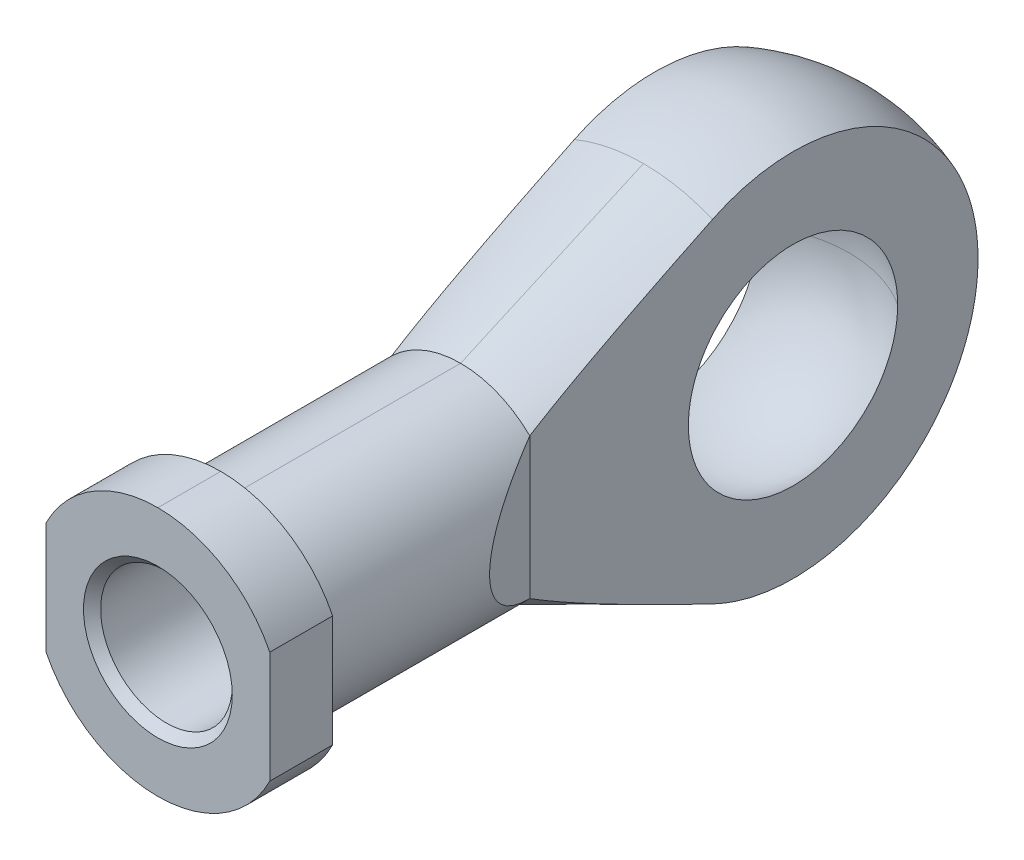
ISO-10303-21;
HEADER;
FILE_DESCRIPTION(('STEP AP214'),'2;1');
FILE_NAME('part.step','',(''),(''),'','','');
FILE_SCHEMA(('AUTOMOTIVE_DESIGN { 1 0 10303 214 1 1 1 1 }'));
ENDSEC;
DATA;
#1=APPLICATION_CONTEXT('core data for automotive mechanical design processes');
#2=APPLICATION_PROTOCOL_DEFINITION('international standard','automotive_design',2000,#1);
#3=PRODUCT_CONTEXT('',#1,'mechanical');
#4=PRODUCT('Part','Part','',(#3));
#5=PRODUCT_RELATED_PRODUCT_CATEGORY('part','',(#4));
#6=PRODUCT_DEFINITION_FORMATION('','',#4);
#7=PRODUCT_DEFINITION_CONTEXT('part definition',#1,'design');
#8=PRODUCT_DEFINITION('design','',#6,#7);
#9=PRODUCT_DEFINITION_SHAPE('','',#8);
#10=(LENGTH_UNIT() NAMED_UNIT(*) SI_UNIT(.MILLI.,.METRE.));
#11=(NAMED_UNIT(*) PLANE_ANGLE_UNIT() SI_UNIT($,.RADIAN.));
#12=(NAMED_UNIT(*) SI_UNIT($,.STERADIAN.) SOLID_ANGLE_UNIT());
#13=UNCERTAINTY_MEASURE_WITH_UNIT(LENGTH_MEASURE(1.E-05),#10,'distance_accuracy_value','');
#14=(GEOMETRIC_REPRESENTATION_CONTEXT(3) GLOBAL_UNCERTAINTY_ASSIGNED_CONTEXT((#13)) GLOBAL_UNIT_ASSIGNED_CONTEXT((#10,
#11,#12)) REPRESENTATION_CONTEXT('',''));
#15=CARTESIAN_POINT('',(0.,0.,0.));
#16=DIRECTION('',(0.,0.,1.));
#17=DIRECTION('',(1.,0.,0.));
#18=AXIS2_PLACEMENT_3D('',#15,#16,#17);
#19=CARTESIAN_POINT('',(0.,4.75,43.));
#20=DIRECTION('',(0.,0.,1.));
#21=DIRECTION('',(1.,0.,0.));
#22=AXIS2_PLACEMENT_3D('',#19,#20,#21);
#23=PLANE('',#22);
#24=CARTESIAN_POINT('',(0.,0.,43.));
#25=DIRECTION('',(0.,0.,1.));
#26=DIRECTION('',(1.,0.,0.));
#27=AXIS2_PLACEMENT_3D('',#24,#25,#26);
#28=CIRCLE('',#27,5.65000000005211);
#29=CARTESIAN_POINT('',(5.65000000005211,0.,43.));
#30=VERTEX_POINT('',#29);
#31=EDGE_CURVE('E23',#30,#30,#28,.F.);
#32=ORIENTED_EDGE('',*,*,#31,.T.);
#33=EDGE_LOOP('',(#32));
#34=FACE_BOUND('',#33,.T.);
#35=CARTESIAN_POINT('',(0.,0.,43.));
#36=DIRECTION('',(0.,0.,1.));
#37=DIRECTION('',(1.,0.,0.));
#38=AXIS2_PLACEMENT_3D('',#35,#36,#37);
#39=CIRCLE('',#38,9.5);
#40=CARTESIAN_POINT('',(0.,9.5,43.));
#41=VERTEX_POINT('',#40);
#42=CARTESIAN_POINT('',(8.5,4.24264068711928,43.));
#43=VERTEX_POINT('',#42);
#44=EDGE_CURVE('E148',#41,#43,#39,.F.);
#45=ORIENTED_EDGE('',*,*,#44,.F.);
#46=CARTESIAN_POINT('',(0.,0.,43.));
#47=DIRECTION('',(0.,0.,1.));
#48=DIRECTION('',(1.,0.,0.));
#49=AXIS2_PLACEMENT_3D('',#46,#47,#48);
#50=CIRCLE('',#49,9.5);
#51=CARTESIAN_POINT('',(-8.5,4.24264068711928,43.));
#52=VERTEX_POINT('',#51);
#53=EDGE_CURVE('E157',#52,#41,#50,.F.);
#54=ORIENTED_EDGE('',*,*,#53,.F.);
#55=DIRECTION('',(0.,1.,0.));
#56=VECTOR('',#55,1.);
#57=CARTESIAN_POINT('',(-8.5,30.,43.));
#58=LINE('',#57,#56);
#59=CARTESIAN_POINT('',(-8.5,-4.24264068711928,43.));
#60=VERTEX_POINT('',#59);
#61=EDGE_CURVE('E164',#52,#60,#58,.F.);
#62=ORIENTED_EDGE('',*,*,#61,.T.);
#63=CARTESIAN_POINT('',(0.,0.,43.));
#64=DIRECTION('',(0.,0.,1.));
#65=DIRECTION('',(1.,0.,0.));
#66=AXIS2_PLACEMENT_3D('',#63,#64,#65);
#67=CIRCLE('',#66,9.5);
#68=CARTESIAN_POINT('',(0.,-9.5,43.));
#69=VERTEX_POINT('',#68);
#70=EDGE_CURVE('E128',#69,#60,#67,.F.);
#71=ORIENTED_EDGE('',*,*,#70,.F.);
#72=CARTESIAN_POINT('',(0.,0.,43.));
#73=DIRECTION('',(0.,0.,1.));
#74=DIRECTION('',(1.,0.,0.));
#75=AXIS2_PLACEMENT_3D('',#72,#73,#74);
#76=CIRCLE('',#75,9.5);
#77=CARTESIAN_POINT('',(8.5,-4.24264068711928,43.));
#78=VERTEX_POINT('',#77);
#79=EDGE_CURVE('E123',#78,#69,#76,.F.);
#80=ORIENTED_EDGE('',*,*,#79,.F.);
#81=DIRECTION('',(0.,1.,0.));
#82=VECTOR('',#81,1.);
#83=CARTESIAN_POINT('',(8.5,30.,43.));
#84=LINE('',#83,#82);
#85=EDGE_CURVE('E126',#78,#43,#84,.T.);
#86=ORIENTED_EDGE('',*,*,#85,.T.);
#87=EDGE_LOOP('',(#45,#54,#62,#71,#80,#86));
#88=FACE_BOUND('',#87,.T.);
#89=ADVANCED_FACE('F14',(#34,#88),#23,.T.);
#90=CARTESIAN_POINT('',(0.,0.,40.6111111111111));
#91=DIRECTION('',(0.,0.,1.));
#92=DIRECTION('',(1.,0.,0.));
#93=AXIS2_PLACEMENT_3D('',#90,#91,#92);
#94=CYLINDRICAL_SURFACE('',#93,9.5);
#95=DIRECTION('',(0.,0.,1.));
#96=VECTOR('',#95,1.);
#97=CARTESIAN_POINT('',(8.5,-4.24264068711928,38.2222222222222));
#98=LINE('',#97,#96);
#99=CARTESIAN_POINT('',(8.5,-4.24264068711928,38.2222222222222));
#100=VERTEX_POINT('',#99);
#101=EDGE_CURVE('E140',#100,#78,#98,.T.);
#102=ORIENTED_EDGE('',*,*,#101,.T.);
#103=ORIENTED_EDGE('',*,*,#79,.T.);
#104=DIRECTION('',(0.,0.,1.));
#105=VECTOR('',#104,1.);
#106=CARTESIAN_POINT('',(0.,-9.5,40.6111111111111));
#107=LINE('',#106,#105);
#108=CARTESIAN_POINT('',(0.,-9.5,38.2222222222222));
#109=VERTEX_POINT('',#108);
#110=EDGE_CURVE('E133',#109,#69,#107,.T.);
#111=ORIENTED_EDGE('',*,*,#110,.F.);
#112=CARTESIAN_POINT('',(0.,0.,38.2222222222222));
#113=DIRECTION('',(0.,0.,1.));
#114=DIRECTION('',(1.,0.,0.));
#115=AXIS2_PLACEMENT_3D('',#112,#113,#114);
#116=CIRCLE('',#115,9.5);
#117=EDGE_CURVE('E147',#100,#109,#116,.F.);
#118=ORIENTED_EDGE('',*,*,#117,.F.);
#119=EDGE_LOOP('',(#102,#103,#111,#118));
#120=FACE_BOUND('',#119,.T.);
#121=ADVANCED_FACE('F146',(#120),#94,.T.);
#122=CARTESIAN_POINT('',(0.,0.,40.6111111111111));
#123=DIRECTION('',(0.,0.,1.));
#124=DIRECTION('',(1.,0.,0.));
#125=AXIS2_PLACEMENT_3D('',#122,#123,#124);
#126=CYLINDRICAL_SURFACE('',#125,9.5);
#127=DIRECTION('',(0.,0.,-1.));
#128=VECTOR('',#127,1.);
#129=CARTESIAN_POINT('',(-8.5,-4.24264068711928,73.));
#130=LINE('',#129,#128);
#131=CARTESIAN_POINT('',(-8.5,-4.24264068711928,38.2222222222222));
#132=VERTEX_POINT('',#131);
#133=EDGE_CURVE('E161',#60,#132,#130,.T.);
#134=ORIENTED_EDGE('',*,*,#133,.T.);
#135=CARTESIAN_POINT('',(0.,0.,38.2222222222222));
#136=DIRECTION('',(0.,0.,1.));
#137=DIRECTION('',(1.,0.,0.));
#138=AXIS2_PLACEMENT_3D('',#135,#136,#137);
#139=CIRCLE('',#138,9.5);
#140=EDGE_CURVE('E494',#109,#132,#139,.F.);
#141=ORIENTED_EDGE('',*,*,#140,.F.);
#142=ORIENTED_EDGE('',*,*,#110,.T.);
#143=ORIENTED_EDGE('',*,*,#70,.T.);
#144=EDGE_LOOP('',(#134,#141,#142,#143));
#145=FACE_BOUND('',#144,.T.);
#146=ADVANCED_FACE('F511',(#145),#126,.T.);
#147=CARTESIAN_POINT('',(-8.5,30.,73.));
#148=DIRECTION('',(1.,0.,0.));
#149=DIRECTION('',(0.,0.,-1.));
#150=AXIS2_PLACEMENT_3D('',#147,#148,#149);
#151=PLANE('',#150);
#152=ORIENTED_EDGE('',*,*,#61,.F.);
#153=DIRECTION('',(0.,0.,1.));
#154=VECTOR('',#153,1.);
#155=CARTESIAN_POINT('',(-8.5,4.24264068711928,40.6111111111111));
#156=LINE('',#155,#154);
#157=CARTESIAN_POINT('',(-8.5,4.24264068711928,38.2222222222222));
#158=VERTEX_POINT('',#157);
#159=EDGE_CURVE('E158',#158,#52,#156,.T.);
#160=ORIENTED_EDGE('',*,*,#159,.F.);
#161=DIRECTION('',(0.,1.,0.));
#162=VECTOR('',#161,1.);
#163=CARTESIAN_POINT('',(-8.5,8.5,38.2222222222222));
#164=LINE('',#163,#162);
#165=EDGE_CURVE('E493',#132,#158,#164,.T.);
#166=ORIENTED_EDGE('',*,*,#165,.F.);
#167=ORIENTED_EDGE('',*,*,#133,.F.);
#168=EDGE_LOOP('',(#152,#160,#166,#167));
#169=FACE_BOUND('',#168,.T.);
#170=ADVANCED_FACE('F516',(#169),#151,.F.);
#171=CARTESIAN_POINT('',(0.,0.,40.6111111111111));
#172=DIRECTION('',(0.,0.,1.));
#173=DIRECTION('',(1.,0.,0.));
#174=AXIS2_PLACEMENT_3D('',#171,#172,#173);
#175=CYLINDRICAL_SURFACE('',#174,9.5);
#176=ORIENTED_EDGE('',*,*,#159,.T.);
#177=ORIENTED_EDGE('',*,*,#53,.T.);
#178=DIRECTION('',(0.,0.,1.));
#179=VECTOR('',#178,1.);
#180=CARTESIAN_POINT('',(0.,9.5,40.6111111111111));
#181=LINE('',#180,#179);
#182=CARTESIAN_POINT('',(0.,9.5,38.2222222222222));
#183=VERTEX_POINT('',#182);
#184=EDGE_CURVE('E150',#183,#41,#181,.T.);
#185=ORIENTED_EDGE('',*,*,#184,.F.);
#186=CARTESIAN_POINT('',(0.,0.,38.2222222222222));
#187=DIRECTION('',(0.,0.,1.));
#188=DIRECTION('',(1.,0.,0.));
#189=AXIS2_PLACEMENT_3D('',#186,#187,#188);
#190=CIRCLE('',#189,9.5);
#191=EDGE_CURVE('E491',#158,#183,#190,.F.);
#192=ORIENTED_EDGE('',*,*,#191,.F.);
#193=EDGE_LOOP('',(#176,#177,#185,#192));
#194=FACE_BOUND('',#193,.T.);
#195=ADVANCED_FACE('F520',(#194),#175,.T.);
#196=CARTESIAN_POINT('',(0.,0.,40.6111111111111));
#197=DIRECTION('',(0.,0.,1.));
#198=DIRECTION('',(1.,0.,0.));
#199=AXIS2_PLACEMENT_3D('',#196,#197,#198);
#200=CYLINDRICAL_SURFACE('',#199,9.5);
#201=DIRECTION('',(0.,0.,1.));
#202=VECTOR('',#201,1.);
#203=CARTESIAN_POINT('',(8.5,4.24264068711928,38.2222222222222));
#204=LINE('',#203,#202);
#205=CARTESIAN_POINT('',(8.5,4.24264068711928,38.2222222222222));
#206=VERTEX_POINT('',#205);
#207=EDGE_CURVE('E143',#43,#206,#204,.F.);
#208=ORIENTED_EDGE('',*,*,#207,.T.);
#209=CARTESIAN_POINT('',(0.,0.,38.2222222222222));
#210=DIRECTION('',(0.,0.,1.));
#211=DIRECTION('',(1.,0.,0.));
#212=AXIS2_PLACEMENT_3D('',#209,#210,#211);
#213=CIRCLE('',#212,9.5);
#214=EDGE_CURVE('E489',#183,#206,#213,.F.);
#215=ORIENTED_EDGE('',*,*,#214,.F.);
#216=ORIENTED_EDGE('',*,*,#184,.T.);
#217=ORIENTED_EDGE('',*,*,#44,.T.);
#218=EDGE_LOOP('',(#208,#215,#216,#217));
#219=FACE_BOUND('',#218,.T.);
#220=ADVANCED_FACE('F524',(#219),#200,.T.);
#221=CARTESIAN_POINT('',(8.5,30.,38.2222222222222));
#222=DIRECTION('',(-1.,0.,0.));
#223=DIRECTION('',(0.,0.,1.));
#224=AXIS2_PLACEMENT_3D('',#221,#222,#223);
#225=PLANE('',#224);
#226=ORIENTED_EDGE('',*,*,#85,.F.);
#227=ORIENTED_EDGE('',*,*,#101,.F.);
#228=DIRECTION('',(0.,1.,0.));
#229=VECTOR('',#228,1.);
#230=CARTESIAN_POINT('',(8.5,8.5,38.2222222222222));
#231=LINE('',#230,#229);
#232=EDGE_CURVE('E412',#206,#100,#231,.F.);
#233=ORIENTED_EDGE('',*,*,#232,.F.);
#234=ORIENTED_EDGE('',*,*,#207,.F.);
#235=EDGE_LOOP('',(#226,#227,#233,#234));
#236=FACE_BOUND('',#235,.T.);
#237=ADVANCED_FACE('F138',(#236),#225,.F.);
#238=CARTESIAN_POINT('',(5.25,30.,20.));
#239=DIRECTION('',(-0.92050485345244,0.,0.390731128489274));
#240=DIRECTION('',(0.390731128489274,0.,0.92050485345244));
#241=AXIS2_PLACEMENT_3D('',#238,#239,#240);
#242=PLANE('',#241);
#243=DIRECTION('',(0.,1.,0.));
#244=VECTOR('',#243,1.);
#245=CARTESIAN_POINT('',(5.25,30.,20.));
#246=LINE('',#245,#244);
#247=CARTESIAN_POINT('',(5.25,-5.35607132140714,20.));
#248=VERTEX_POINT('',#247);
#249=CARTESIAN_POINT('',(5.25,5.35607132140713,20.));
#250=VERTEX_POINT('',#249);
#251=EDGE_CURVE('E387',#248,#250,#246,.T.);
#252=ORIENTED_EDGE('',*,*,#251,.T.);
#253=CARTESIAN_POINT('',(0.,0.,7.63177507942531));
#254=DIRECTION('',(-0.92050485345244,0.,0.390731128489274));
#255=DIRECTION('',(0.390731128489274,0.,0.92050485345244));
#256=AXIS2_PLACEMENT_3D('',#253,#254,#255);
#257=ELLIPSE('',#256,19.1947849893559,7.5);
#258=EDGE_CURVE('E499',#248,#250,#257,.T.);
#259=ORIENTED_EDGE('',*,*,#258,.F.);
#260=EDGE_LOOP('',(#252,#259));
#261=FACE_BOUND('',#260,.T.);
#262=ADVANCED_FACE('F531',(#261),#242,.F.);
#263=CARTESIAN_POINT('',(0.,0.,29.1111111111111));
#264=DIRECTION('',(0.,0.,1.));
#265=DIRECTION('',(1.,0.,0.));
#266=AXIS2_PLACEMENT_3D('',#263,#264,#265);
#267=CYLINDRICAL_SURFACE('',#266,7.5);
#268=ORIENTED_EDGE('',*,*,#258,.T.);
#269=CARTESIAN_POINT('',(0.,0.,20.));
#270=DIRECTION('',(0.,0.,-1.));
#271=DIRECTION('',(0.,1.,0.));
#272=AXIS2_PLACEMENT_3D('',#269,#270,#271);
#273=CIRCLE('',#272,7.5);
#274=CARTESIAN_POINT('',(0.,7.5,20.));
#275=VERTEX_POINT('',#274);
#276=EDGE_CURVE('E381',#275,#250,#273,.T.);
#277=ORIENTED_EDGE('',*,*,#276,.F.);
#278=DIRECTION('',(0.,0.,1.));
#279=VECTOR('',#278,1.);
#280=CARTESIAN_POINT('',(0.,7.5,29.1111111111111));
#281=LINE('',#280,#279);
#282=CARTESIAN_POINT('',(0.,7.5,38.2222222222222));
#283=VERTEX_POINT('',#282);
#284=EDGE_CURVE('E366',#283,#275,#281,.F.);
#285=ORIENTED_EDGE('',*,*,#284,.F.);
#286=CARTESIAN_POINT('',(0.,0.,38.2222222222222));
#287=DIRECTION('',(0.,0.,1.));
#288=DIRECTION('',(1.,0.,0.));
#289=AXIS2_PLACEMENT_3D('',#286,#287,#288);
#290=CIRCLE('',#289,7.5);
#291=CARTESIAN_POINT('',(0.,-7.5,38.2222222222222));
#292=VERTEX_POINT('',#291);
#293=EDGE_CURVE('E497',#292,#283,#290,.T.);
#294=ORIENTED_EDGE('',*,*,#293,.F.);
#295=DIRECTION('',(0.,0.,1.));
#296=VECTOR('',#295,1.);
#297=CARTESIAN_POINT('',(0.,-7.5,29.1111111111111));
#298=LINE('',#297,#296);
#299=CARTESIAN_POINT('',(0.,-7.5,20.));
#300=VERTEX_POINT('',#299);
#301=EDGE_CURVE('E374',#300,#292,#298,.T.);
#302=ORIENTED_EDGE('',*,*,#301,.F.);
#303=CARTESIAN_POINT('',(0.,0.,20.));
#304=DIRECTION('',(0.,0.,-1.));
#305=DIRECTION('',(0.,1.,0.));
#306=AXIS2_PLACEMENT_3D('',#303,#304,#305);
#307=CIRCLE('',#306,7.5);
#308=EDGE_CURVE('E390',#248,#300,#307,.T.);
#309=ORIENTED_EDGE('',*,*,#308,.F.);
#310=EDGE_LOOP('',(#268,#277,#285,#294,#302,#309));
#311=FACE_BOUND('',#310,.T.);
#312=ADVANCED_FACE('F534',(#311),#267,.T.);
#313=CARTESIAN_POINT('',(0.,8.5,38.2222222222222));
#314=DIRECTION('',(0.,0.,-1.));
#315=DIRECTION('',(-1.,0.,0.));
#316=AXIS2_PLACEMENT_3D('',#313,#314,#315);
#317=PLANE('',#316);
#318=ORIENTED_EDGE('',*,*,#214,.T.);
#319=ORIENTED_EDGE('',*,*,#232,.T.);
#320=ORIENTED_EDGE('',*,*,#117,.T.);
#321=ORIENTED_EDGE('',*,*,#140,.T.);
#322=ORIENTED_EDGE('',*,*,#165,.T.);
#323=ORIENTED_EDGE('',*,*,#191,.T.);
#324=EDGE_LOOP('',(#318,#319,#320,#321,#322,#323));
#325=FACE_BOUND('',#324,.T.);
#326=ORIENTED_EDGE('',*,*,#293,.T.);
#327=CARTESIAN_POINT('',(0.,0.,38.2222222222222));
#328=DIRECTION('',(0.,0.,1.));
#329=DIRECTION('',(1.,0.,0.));
#330=AXIS2_PLACEMENT_3D('',#327,#328,#329);
#331=CIRCLE('',#330,7.5);
#332=EDGE_CURVE('E407',#292,#283,#331,.F.);
#333=ORIENTED_EDGE('',*,*,#332,.F.);
#334=EDGE_LOOP('',(#326,#333));
#335=FACE_BOUND('',#334,.T.);
#336=ADVANCED_FACE('F537',(#325,#335),#317,.T.);
#337=CARTESIAN_POINT('',(0.,0.,6.11336556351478));
#338=DIRECTION('',(0.,0.,-1.));
#339=DIRECTION('',(-1.,0.,0.));
#340=AXIS2_PLACEMENT_3D('',#337,#338,#339);
#341=CONICAL_SURFACE('',#340,13.6976918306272,0.419777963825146);
#342=CARTESIAN_POINT('',(5.25,-12.6516505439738,6.11336556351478));
#343=CARTESIAN_POINT('',(5.25,-12.3671376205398,6.70208831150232));
#344=CARTESIAN_POINT('',(5.25,-12.0815391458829,7.29029045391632));
#345=CARTESIAN_POINT('',(5.25,-11.5075354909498,8.46531081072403));
#346=CARTESIAN_POINT('',(5.25,-11.2191303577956,9.05212904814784));
#347=CARTESIAN_POINT('',(5.25,-10.6390269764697,10.2237381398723));
#348=CARTESIAN_POINT('',(5.25,-10.3473306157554,10.808529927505));
#349=CARTESIAN_POINT('',(5.25,-9.75955152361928,11.9759336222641));
#350=CARTESIAN_POINT('',(5.25,-9.46346864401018,12.5585454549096));
#351=CARTESIAN_POINT('',(5.25,-8.86548275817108,13.7211504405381));
#352=CARTESIAN_POINT('',(5.25,-8.56357689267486,14.3011421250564));
#353=CARTESIAN_POINT('',(5.25,-7.95224611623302,15.4571051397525));
#354=CARTESIAN_POINT('',(5.25,-7.64282186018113,16.0330768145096));
#355=CARTESIAN_POINT('',(5.25,-7.17074618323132,16.8928979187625));
#356=CARTESIAN_POINT('',(5.25,-7.01201613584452,17.1788997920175));
#357=CARTESIAN_POINT('',(5.25,-6.6914055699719,17.7491244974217));
#358=CARTESIAN_POINT('',(5.25,-6.52952513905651,18.0333473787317));
#359=CARTESIAN_POINT('',(5.25,-6.20190139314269,18.5996743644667));
#360=CARTESIAN_POINT('',(5.25,-6.03615697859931,18.88177783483));
#361=CARTESIAN_POINT('',(5.25,-5.78400383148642,19.3028326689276));
#362=CARTESIAN_POINT('',(5.25,-5.6993591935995,19.4428409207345));
#363=CARTESIAN_POINT('',(5.25,-5.52874511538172,19.7220515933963));
#364=CARTESIAN_POINT('',(5.25,-5.44277564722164,19.8612539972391));
#365=CARTESIAN_POINT('',(5.25,-5.35607132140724,20.));
#366=B_SPLINE_CURVE_WITH_KNOTS('',3,(#342,#343,#344,#345,#346,#347,#348,#349,#350,#351,#352,
#353,#354,#355,#356,#357,#358,#359,#360,#361,#362,#363,#364,#365),.UNSPECIFIED.,.F.,.F.,(4,2,2,
2,2,2,2,2,2,2,2,4),(0.,1.96160538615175,3.92317789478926,5.88367751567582,7.84424351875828,
9.80579804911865,11.7671823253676,12.7484569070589,13.7297042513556,14.7112343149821,
15.202046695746,15.6928694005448),.UNSPECIFIED.);
#367=CARTESIAN_POINT('',(5.25,-12.6516505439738,6.11336556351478));
#368=VERTEX_POINT('',#367);
#369=EDGE_CURVE('E384',#368,#248,#366,.T.);
#370=ORIENTED_EDGE('',*,*,#369,.T.);
#371=ORIENTED_EDGE('',*,*,#308,.T.);
#372=DIRECTION('',(0.,0.40755770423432,0.913179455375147));
#373=VECTOR('',#372,1.);
#374=CARTESIAN_POINT('',(0.,-10.5988459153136,13.0566827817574));
#375=LINE('',#374,#373);
#376=CARTESIAN_POINT('',(0.,-13.6976918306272,6.1133655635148));
#377=VERTEX_POINT('',#376);
#378=EDGE_CURVE('E236',#377,#300,#375,.T.);
#379=ORIENTED_EDGE('',*,*,#378,.F.);
#380=CARTESIAN_POINT('',(0.,0.,6.11336556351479));
#381=DIRECTION('',(0.,0.,1.));
#382=DIRECTION('',(0.,1.,0.));
#383=AXIS2_PLACEMENT_3D('',#380,#381,#382);
#384=CIRCLE('',#383,13.6976918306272);
#385=EDGE_CURVE('E226',#368,#377,#384,.F.);
#386=ORIENTED_EDGE('',*,*,#385,.F.);
#387=EDGE_LOOP('',(#370,#371,#379,#386));
#388=FACE_BOUND('',#387,.T.);
#389=ADVANCED_FACE('F444',(#388),#341,.T.);
#390=CARTESIAN_POINT('',(5.25,30.,-23.));
#391=DIRECTION('',(-1.,0.,0.));
#392=DIRECTION('',(0.,0.,1.));
#393=AXIS2_PLACEMENT_3D('',#390,#391,#392);
#394=PLANE('',#393);
#395=CARTESIAN_POINT('',(5.25,0.,-14.0512454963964));
#396=CARTESIAN_POINT('',(5.25,-0.395190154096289,-14.0512879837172));
#397=CARTESIAN_POINT('',(5.25,-0.790374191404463,-14.034575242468));
#398=CARTESIAN_POINT('',(5.25,-1.57791509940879,-13.9679461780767));
#399=CARTESIAN_POINT('',(5.25,-1.97027210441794,-13.918031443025));
#400=CARTESIAN_POINT('',(5.25,-2.74911944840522,-13.7853499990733));
#401=CARTESIAN_POINT('',(5.25,-3.13561356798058,-13.7026054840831));
#402=CARTESIAN_POINT('',(5.25,-3.90025651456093,-13.5048665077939));
#403=CARTESIAN_POINT('',(5.25,-4.27840544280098,-13.3898724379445));
#404=CARTESIAN_POINT('',(5.25,-5.0238513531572,-13.1283857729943));
#405=CARTESIAN_POINT('',(5.25,-5.39114315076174,-12.9818783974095));
#406=CARTESIAN_POINT('',(5.25,-6.11207739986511,-12.6584397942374));
#407=CARTESIAN_POINT('',(5.25,-6.46571984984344,-12.4815085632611));
#408=CARTESIAN_POINT('',(5.25,-7.15676440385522,-12.0985224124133));
#409=CARTESIAN_POINT('',(5.25,-7.49417006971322,-11.8924739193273));
#410=CARTESIAN_POINT('',(5.25,-8.15042468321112,-11.4526894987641));
#411=CARTESIAN_POINT('',(5.25,-8.46927371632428,-11.2189536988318));
#412=CARTESIAN_POINT('',(5.25,-9.08615201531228,-10.7254539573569));
#413=CARTESIAN_POINT('',(5.25,-9.3841811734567,-10.4656898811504));
#414=CARTESIAN_POINT('',(5.25,-9.95730007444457,-9.92198048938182));
#415=CARTESIAN_POINT('',(5.25,-10.2323897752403,-9.63803512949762));
#416=CARTESIAN_POINT('',(5.25,-10.7577302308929,-9.04791847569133));
#417=CARTESIAN_POINT('',(5.25,-11.0079756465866,-8.74174242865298));
#418=CARTESIAN_POINT('',(5.25,-11.4817808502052,-8.10939559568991));
#419=CARTESIAN_POINT('',(5.25,-11.7053406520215,-7.78322482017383));
#420=CARTESIAN_POINT('',(5.25,-12.124184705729,-7.11320835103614));
#421=CARTESIAN_POINT('',(5.25,-12.3194690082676,-6.76936268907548));
#422=CARTESIAN_POINT('',(5.25,-12.6803740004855,-6.06644073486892));
#423=CARTESIAN_POINT('',(5.25,-12.8459946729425,-5.7073644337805));
#424=CARTESIAN_POINT('',(5.25,-13.1463628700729,-4.97661185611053));
#425=CARTESIAN_POINT('',(5.25,-13.2811168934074,-4.60493825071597));
#426=CARTESIAN_POINT('',(5.25,-13.5188384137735,-3.85156194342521));
#427=CARTESIAN_POINT('',(5.25,-13.6218059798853,-3.4698592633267));
#428=CARTESIAN_POINT('',(5.25,-13.7952231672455,-2.69913682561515));
#429=CARTESIAN_POINT('',(5.25,-13.8656727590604,-2.31011706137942));
#430=CARTESIAN_POINT('',(5.25,-13.97355344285,-1.52752342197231));
#431=CARTESIAN_POINT('',(5.25,-14.010984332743,-1.13394951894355));
#432=CARTESIAN_POINT('',(5.25,-14.0525650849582,-0.344967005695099));
#433=CARTESIAN_POINT('',(5.25,-14.0567081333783,0.0504419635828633));
#434=CARTESIAN_POINT('',(5.25,-14.0316658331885,0.84020270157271));
#435=CARTESIAN_POINT('',(5.25,-14.0024806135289,1.23455447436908));
#436=CARTESIAN_POINT('',(5.25,-13.9114547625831,2.0154036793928));
#437=CARTESIAN_POINT('',(5.25,-13.8499491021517,2.40194020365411));
#438=CARTESIAN_POINT('',(5.25,-13.6949187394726,3.16854052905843));
#439=CARTESIAN_POINT('',(5.25,-13.6013939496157,3.54860431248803));
#440=CARTESIAN_POINT('',(5.25,-13.3829009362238,4.29982415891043));
#441=CARTESIAN_POINT('',(5.25,-13.2579143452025,4.67097487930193));
#442=CARTESIAN_POINT('',(5.25,-12.9774340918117,5.4015864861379));
#443=CARTESIAN_POINT('',(5.25,-12.8219387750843,5.76104673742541));
#444=CARTESIAN_POINT('',(5.25,-12.6516505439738,6.11336556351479));
#445=B_SPLINE_CURVE_WITH_KNOTS('',3,(#395,#396,#397,#398,#399,#400,#401,#402,#403,#404,#405,
#406,#407,#408,#409,#410,#411,#412,#413,#414,#415,#416,#417,#418,#419,#420,#421,#422,#423,#424,
#425,#426,#427,#428,#429,#430,#431,#432,#433,#434,#435,#436,#437,#438,#439,#440,#441,#442,#443,
#444),.UNSPECIFIED.,.F.,.F.,(4,2,2,2,2,2,2,2,2,2,2,2,2,2,2,2,2,2,2,2,2,2,2,2,4),(0.,
1.18520858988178,2.37036049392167,3.55471256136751,4.73905025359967,5.9239446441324,
7.10883916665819,8.29347256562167,9.47810050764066,10.662734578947,11.847370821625,
13.0322611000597,14.2171507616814,15.4020383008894,16.5869265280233,17.7715650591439,
18.9562010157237,20.1408380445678,21.3254823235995,22.5103690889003,23.6952512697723,
24.8680886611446,26.0409292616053,27.2144561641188,28.388046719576),.UNSPECIFIED.);
#446=CARTESIAN_POINT('',(5.25,0.,-14.0512454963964));
#447=VERTEX_POINT('',#446);
#448=EDGE_CURVE('E231',#447,#368,#445,.T.);
#449=ORIENTED_EDGE('',*,*,#448,.F.);
#450=CARTESIAN_POINT('',(5.25,12.6516505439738,6.11336556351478));
#451=CARTESIAN_POINT('',(5.25,12.8236267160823,5.75755739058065));
#452=CARTESIAN_POINT('',(5.25,12.9805139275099,5.39446492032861));
#453=CARTESIAN_POINT('',(5.25,13.2631620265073,4.656379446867));
#454=CARTESIAN_POINT('',(5.25,13.3889244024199,4.28138701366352));
#455=CARTESIAN_POINT('',(5.25,13.6083170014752,3.52239133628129));
#456=CARTESIAN_POINT('',(5.25,13.7019688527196,3.13839434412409));
#457=CARTESIAN_POINT('',(5.25,13.8566040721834,2.36388321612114));
#458=CARTESIAN_POINT('',(5.25,13.9175878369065,1.97336915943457));
#459=CARTESIAN_POINT('',(5.25,14.0064728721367,1.18840780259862));
#460=CARTESIAN_POINT('',(5.25,14.0343585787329,0.793958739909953));
#461=CARTESIAN_POINT('',(5.25,14.0567980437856,0.00411369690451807));
#462=CARTESIAN_POINT('',(5.25,14.0513517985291,-0.391282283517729));
#463=CARTESIAN_POINT('',(5.25,14.0071707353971,-1.1801225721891));
#464=CARTESIAN_POINT('',(5.25,13.9684432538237,-1.57356729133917));
#465=CARTESIAN_POINT('',(5.25,13.8579851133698,-2.35579453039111));
#466=CARTESIAN_POINT('',(5.25,13.7862546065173,-2.74457707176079));
#467=CARTESIAN_POINT('',(5.25,13.6102998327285,-3.51472040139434));
#468=CARTESIAN_POINT('',(5.25,13.5060753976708,-3.89608115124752));
#469=CARTESIAN_POINT('',(5.25,13.2658734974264,-4.64866883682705));
#470=CARTESIAN_POINT('',(5.25,13.1298959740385,-5.01989575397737));
#471=CARTESIAN_POINT('',(5.25,12.8271220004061,-5.74965474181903));
#472=CARTESIAN_POINT('',(5.25,12.6603189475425,-6.10818407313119));
#473=CARTESIAN_POINT('',(5.25,12.2970994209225,-6.8099144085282));
#474=CARTESIAN_POINT('',(5.25,12.1006829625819,-7.15311542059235));
#475=CARTESIAN_POINT('',(5.25,11.6796336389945,-7.82174826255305));
#476=CARTESIAN_POINT('',(5.25,11.4550008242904,-8.14718012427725));
#477=CARTESIAN_POINT('',(5.25,10.9791156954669,-8.77796141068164));
#478=CARTESIAN_POINT('',(5.25,10.7278633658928,-9.0833108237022));
#479=CARTESIAN_POINT('',(5.25,10.2005815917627,-9.67169361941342));
#480=CARTESIAN_POINT('',(5.25,9.92455737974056,-9.95473169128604));
#481=CARTESIAN_POINT('',(5.25,9.3496492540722,-10.4965508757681));
#482=CARTESIAN_POINT('',(5.25,9.05076539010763,-10.7553320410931));
#483=CARTESIAN_POINT('',(5.25,8.43226162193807,-11.2467989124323));
#484=CARTESIAN_POINT('',(5.25,8.11264169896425,-11.4794845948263));
#485=CARTESIAN_POINT('',(5.25,7.454935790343,-11.9171077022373));
#486=CARTESIAN_POINT('',(5.25,7.11684969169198,-12.1220449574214));
#487=CARTESIAN_POINT('',(5.25,6.4245457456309,-12.5027516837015));
#488=CARTESIAN_POINT('',(5.25,6.07032461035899,-12.6785151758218));
#489=CARTESIAN_POINT('',(5.25,5.34833383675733,-12.9995735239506));
#490=CARTESIAN_POINT('',(5.25,4.98056425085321,-13.1448684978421));
#491=CARTESIAN_POINT('',(5.25,4.23788947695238,-13.4026384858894));
#492=CARTESIAN_POINT('',(5.25,3.86309482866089,-13.5154321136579));
#493=CARTESIAN_POINT('',(5.25,3.10540280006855,-13.7093735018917));
#494=CARTESIAN_POINT('',(5.25,2.7225053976,-13.7905211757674));
#495=CARTESIAN_POINT('',(5.25,1.95105075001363,-13.9206295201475));
#496=CARTESIAN_POINT('',(5.25,1.56249032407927,-13.9695713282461));
#497=CARTESIAN_POINT('',(5.25,0.782622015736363,-14.0349006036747));
#498=CARTESIAN_POINT('',(5.25,0.391313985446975,-14.0512863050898));
#499=CARTESIAN_POINT('',(5.25,0.,-14.0512454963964));
#500=B_SPLINE_CURVE_WITH_KNOTS('',3,(#450,#451,#452,#453,#454,#455,#456,#457,#458,#459,#460,
#461,#462,#463,#464,#465,#466,#467,#468,#469,#470,#471,#472,#473,#474,#475,#476,#477,#478,#479,
#480,#481,#482,#483,#484,#485,#486,#487,#488,#489,#490,#491,#492,#493,#494,#495,#496,#497,#498,
#499),.UNSPECIFIED.,.F.,.F.,(4,2,2,2,2,2,2,2,2,2,2,2,2,2,2,2,2,2,2,2,2,2,2,2,4),(0.,
1.18520858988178,2.37036049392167,3.55471256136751,4.73905025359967,5.92394464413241,
7.10883916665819,8.29347256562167,9.47810050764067,10.662734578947,11.847370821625,
13.0322611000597,14.2171507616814,15.4020383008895,16.5869265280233,17.7715650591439,
18.9562010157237,20.1408380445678,21.3254823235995,22.5103690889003,23.6952512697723,
24.8680886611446,26.0409292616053,27.2144561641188,28.388046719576),.UNSPECIFIED.);
#501=CARTESIAN_POINT('',(5.25,12.6516505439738,6.11336556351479));
#502=VERTEX_POINT('',#501);
#503=EDGE_CURVE('E205',#502,#447,#500,.T.);
#504=ORIENTED_EDGE('',*,*,#503,.F.);
#505=CARTESIAN_POINT('',(5.25,5.35607132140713,20.));
#506=CARTESIAN_POINT('',(5.25,5.47407401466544,19.8111480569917));
#507=CARTESIAN_POINT('',(5.25,5.59072967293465,19.6214613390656));
#508=CARTESIAN_POINT('',(5.25,5.82167985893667,19.2406660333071));
#509=CARTESIAN_POINT('',(5.25,5.9359744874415,19.0495575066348));
#510=CARTESIAN_POINT('',(5.25,6.16252732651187,18.6661809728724));
#511=CARTESIAN_POINT('',(5.25,6.27478586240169,18.4739131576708));
#512=CARTESIAN_POINT('',(5.25,6.49754352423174,18.0883589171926));
#513=CARTESIAN_POINT('',(5.25,6.60804262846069,17.8950724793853));
#514=CARTESIAN_POINT('',(5.25,6.93714783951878,17.3140680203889));
#515=CARTESIAN_POINT('',(5.25,7.15345459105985,16.9250470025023));
#516=CARTESIAN_POINT('',(5.25,7.58128506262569,16.1443686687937));
#517=CARTESIAN_POINT('',(5.25,7.79280855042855,15.7527112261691));
#518=CARTESIAN_POINT('',(5.25,8.21188459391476,14.9676001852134));
#519=CARTESIAN_POINT('',(5.25,8.4194395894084,14.574147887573));
#520=CARTESIAN_POINT('',(5.25,8.83142608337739,13.7856220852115));
#521=CARTESIAN_POINT('',(5.25,9.03585763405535,13.3905486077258));
#522=CARTESIAN_POINT('',(5.25,9.44216336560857,12.5990376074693));
#523=CARTESIAN_POINT('',(5.25,9.64403727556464,12.2025999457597));
#524=CARTESIAN_POINT('',(5.25,10.0456268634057,11.4086323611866));
#525=CARTESIAN_POINT('',(5.25,10.24534253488,11.011102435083));
#526=CARTESIAN_POINT('',(5.25,10.630770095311,10.2395064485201));
#527=CARTESIAN_POINT('',(5.25,10.8165904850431,9.86549454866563));
#528=CARTESIAN_POINT('',(5.25,11.1868341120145,9.11679837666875));
#529=CARTESIAN_POINT('',(5.25,11.3712574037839,8.74211413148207));
#530=CARTESIAN_POINT('',(5.25,11.7389462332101,7.99205485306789));
#531=CARTESIAN_POINT('',(5.25,11.9222114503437,7.61667966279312));
#532=CARTESIAN_POINT('',(5.25,12.2876873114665,6.8653984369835));
#533=CARTESIAN_POINT('',(5.25,12.4698979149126,6.4894923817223));
#534=CARTESIAN_POINT('',(5.25,12.6516505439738,6.11336556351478));
#535=B_SPLINE_CURVE_WITH_KNOTS('',3,(#505,#506,#507,#508,#509,#510,#511,#512,#513,#514,#515,
#516,#517,#518,#519,#520,#521,#522,#523,#524,#525,#526,#527,#528,#529,#530,#531,#532,#533,#534),
.UNSPECIFIED.,.F.,.F.,(4,2,2,2,2,2,2,2,2,2,2,2,2,2,4),(0.,0.66804814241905,1.33606771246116,
2.00397958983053,2.67189970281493,4.00719075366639,5.34254649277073,6.6770529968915,
8.01153717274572,9.34616154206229,10.6807898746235,11.9336741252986,13.1865092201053,
14.439677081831,15.6928928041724),.UNSPECIFIED.);
#536=EDGE_CURVE('E375',#250,#502,#535,.T.);
#537=ORIENTED_EDGE('',*,*,#536,.F.);
#538=ORIENTED_EDGE('',*,*,#251,.F.);
#539=ORIENTED_EDGE('',*,*,#369,.F.);
#540=EDGE_LOOP('',(#449,#504,#537,#538,#539));
#541=FACE_BOUND('',#540,.T.);
#542=CARTESIAN_POINT('',(5.25,0.,-7.94752319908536));
#543=CARTESIAN_POINT('',(5.25,-0.223526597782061,-7.9475472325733));
#544=CARTESIAN_POINT('',(5.25,-0.44704973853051,-7.93809407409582));
#545=CARTESIAN_POINT('',(5.25,-0.892496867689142,-7.9004069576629));
#546=CARTESIAN_POINT('',(5.25,-1.11442093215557,-7.87217389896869));
#547=CARTESIAN_POINT('',(5.25,-1.55494449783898,-7.79712692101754));
#548=CARTESIAN_POINT('',(5.25,-1.77354622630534,-7.75032607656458));
#549=CARTESIAN_POINT('',(5.25,-2.20602961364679,-7.63848401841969));
#550=CARTESIAN_POINT('',(5.25,-2.4199113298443,-7.57344302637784));
#551=CARTESIAN_POINT('',(5.25,-2.84153554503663,-7.42554616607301));
#552=CARTESIAN_POINT('',(5.25,-3.0492751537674,-7.34268205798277));
#553=CARTESIAN_POINT('',(5.25,-3.45703771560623,-7.15974507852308));
#554=CARTESIAN_POINT('',(5.25,-3.65706054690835,-7.05967193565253));
#555=CARTESIAN_POINT('',(5.25,-4.04792416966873,-6.84305119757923));
#556=CARTESIAN_POINT('',(5.25,-4.23876681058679,-6.72650693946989));
#557=CARTESIAN_POINT('',(5.25,-4.60995599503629,-6.47775770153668));
#558=CARTESIAN_POINT('',(5.25,-4.79030258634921,-6.3455527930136));
#559=CARTESIAN_POINT('',(5.25,-5.13919270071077,-6.06644234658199));
#560=CARTESIAN_POINT('',(5.25,-5.3077379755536,-5.91953899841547));
#561=CARTESIAN_POINT('',(5.25,-5.63191348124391,-5.61200582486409));
#562=CARTESIAN_POINT('',(5.25,-5.78753921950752,-5.45137126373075));
#563=CARTESIAN_POINT('',(5.25,-6.08469961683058,-5.11756647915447));
#564=CARTESIAN_POINT('',(5.25,-6.22623467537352,-4.94439661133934));
#565=CARTESIAN_POINT('',(5.25,-6.49421448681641,-4.58674566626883));
#566=CARTESIAN_POINT('',(5.25,-6.62065900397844,-4.40226441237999));
#567=CARTESIAN_POINT('',(5.25,-6.85754858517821,-4.02331688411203));
#568=CARTESIAN_POINT('',(5.25,-6.9679946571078,-3.8288512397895));
#569=CARTESIAN_POINT('',(5.25,-7.17211385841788,-3.43130242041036));
#570=CARTESIAN_POINT('',(5.25,-7.26578661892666,-3.22821905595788));
#571=CARTESIAN_POINT('',(5.25,-7.43566913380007,-2.81493399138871));
#572=CARTESIAN_POINT('',(5.25,-7.51188320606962,-2.60473406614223));
#573=CARTESIAN_POINT('',(5.25,-7.64635965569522,-2.17858835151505));
#574=CARTESIAN_POINT('',(5.25,-7.70461582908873,-1.9626406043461));
#575=CARTESIAN_POINT('',(5.25,-7.80271856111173,-1.52664013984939));
#576=CARTESIAN_POINT('',(5.25,-7.84256811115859,-1.30658809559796));
#577=CARTESIAN_POINT('',(5.25,-7.90358893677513,-0.863904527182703));
#578=CARTESIAN_POINT('',(5.25,-7.92475981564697,-0.641272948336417));
#579=CARTESIAN_POINT('',(5.25,-7.94827148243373,-0.195014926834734));
#580=CARTESIAN_POINT('',(5.25,-7.95061203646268,0.0286115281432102));
#581=CARTESIAN_POINT('',(5.25,-7.93644580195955,0.475266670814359));
#582=CARTESIAN_POINT('',(5.25,-7.91993901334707,0.698295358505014));
#583=CARTESIAN_POINT('',(5.25,-7.86819542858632,1.14216948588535));
#584=CARTESIAN_POINT('',(5.25,-7.83295861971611,1.36301492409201));
#585=CARTESIAN_POINT('',(5.25,-7.74400646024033,1.80094760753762));
#586=CARTESIAN_POINT('',(5.25,-7.69029150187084,2.01803493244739));
#587=CARTESIAN_POINT('',(5.25,-7.56475342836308,2.44695153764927));
#588=CARTESIAN_POINT('',(5.25,-7.49292705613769,2.65877986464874));
#589=CARTESIAN_POINT('',(5.25,-7.33170963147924,3.07555942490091));
#590=CARTESIAN_POINT('',(5.25,-7.24232464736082,3.2805130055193));
#591=CARTESIAN_POINT('',(5.25,-7.04658897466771,3.68220539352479));
#592=CARTESIAN_POINT('',(5.25,-6.94023472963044,3.87894246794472));
#593=CARTESIAN_POINT('',(5.25,-6.71133268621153,4.26275312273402));
#594=CARTESIAN_POINT('',(5.25,-6.58878524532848,4.44982691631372));
#595=CARTESIAN_POINT('',(5.25,-6.32837022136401,4.812980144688));
#596=CARTESIAN_POINT('',(5.25,-6.19050310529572,4.98905991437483));
#597=CARTESIAN_POINT('',(5.25,-5.90042809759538,5.32897684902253));
#598=CARTESIAN_POINT('',(5.25,-5.74822043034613,5.49281420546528));
#599=CARTESIAN_POINT('',(5.25,-5.43053715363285,5.80709193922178));
#600=CARTESIAN_POINT('',(5.25,-5.26506093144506,5.95753169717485));
#601=CARTESIAN_POINT('',(5.25,-4.92208256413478,6.24388655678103));
#602=CARTESIAN_POINT('',(5.25,-4.74458459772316,6.37980666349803));
#603=CARTESIAN_POINT('',(5.25,-4.3786799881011,6.63628120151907));
#604=CARTESIAN_POINT('',(5.25,-4.19026786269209,6.75682781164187));
#605=CARTESIAN_POINT('',(5.25,-3.80396254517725,6.98161388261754));
#606=CARTESIAN_POINT('',(5.25,-3.60606964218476,7.08585384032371));
#607=CARTESIAN_POINT('',(5.25,-3.20207688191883,7.27735056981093));
#608=CARTESIAN_POINT('',(5.25,-2.99597189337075,7.36459651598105));
#609=CARTESIAN_POINT('',(5.25,-2.57714314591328,7.52139988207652));
#610=CARTESIAN_POINT('',(5.25,-2.36441953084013,7.59095768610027));
#611=CARTESIAN_POINT('',(5.25,-1.93414683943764,7.71181419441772));
#612=CARTESIAN_POINT('',(5.25,-1.71660428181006,7.76313613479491));
#613=CARTESIAN_POINT('',(5.25,-1.2780566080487,7.84726123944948));
#614=CARTESIAN_POINT('',(5.25,-1.05705324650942,7.88007349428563));
#615=CARTESIAN_POINT('',(5.25,-0.696307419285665,7.91819240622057));
#616=CARTESIAN_POINT('',(5.25,-0.557142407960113,7.92919846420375));
#617=CARTESIAN_POINT('',(5.25,-0.278656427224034,7.94385859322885));
#618=CARTESIAN_POINT('',(5.25,-0.139336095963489,7.94752478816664));
#619=CARTESIAN_POINT('',(5.25,-1.46066511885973E-12,7.94752319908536));
#620=B_SPLINE_CURVE_WITH_KNOTS('',3,(#542,#543,#544,#545,#546,#547,#548,#549,#550,#551,#552,
#553,#554,#555,#556,#557,#558,#559,#560,#561,#562,#563,#564,#565,#566,#567,#568,#569,#570,#571,
#572,#573,#574,#575,#576,#577,#578,#579,#580,#581,#582,#583,#584,#585,#586,#587,#588,#589,#590,
#591,#592,#593,#594,#595,#596,#597,#598,#599,#600,#601,#602,#603,#604,#605,#606,#607,#608,#609,
#610,#611,#612,#613,#614,#615,#616,#617,#618,#619),.UNSPECIFIED.,.F.,.F.,(4,2,2,2,2,2,2,2,2,2,2,
2,2,2,2,2,2,2,2,2,2,2,2,2,2,2,2,2,2,2,2,2,2,2,2,2,2,2,4),(0.,0.670375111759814,1.34071812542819,
2.01058994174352,2.68045361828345,3.35062764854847,4.02081225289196,4.69086127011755,
5.36090723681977,6.03085352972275,6.70103181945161,7.37119110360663,8.04136085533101,
8.7114883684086,9.38163061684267,10.0516069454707,10.7218144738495,11.3919130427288,
12.0620258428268,12.7321469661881,13.4022680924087,14.0723896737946,14.7424970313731,
15.4127249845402,16.0827217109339,16.7528590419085,17.4229815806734,18.0930836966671,
18.7631753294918,19.4332979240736,20.1031887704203,20.773419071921,21.443628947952,
22.1142643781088,22.7848852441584,23.454648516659,24.1240825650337,24.5427033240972,
24.9606320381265),.UNSPECIFIED.);
#621=CARTESIAN_POINT('',(5.25,0.,-7.94752319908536));
#622=VERTEX_POINT('',#621);
#623=CARTESIAN_POINT('',(5.25,-5.1139752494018E-12,7.94752319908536));
#624=VERTEX_POINT('',#623);
#625=EDGE_CURVE('E416',#622,#624,#620,.T.);
#626=ORIENTED_EDGE('',*,*,#625,.T.);
#627=CARTESIAN_POINT('',(5.25,-1.46066511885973E-12,7.94752319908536));
#628=CARTESIAN_POINT('',(5.25,0.223532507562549,7.94754723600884));
#629=CARTESIAN_POINT('',(5.25,0.447061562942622,7.93809357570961));
#630=CARTESIAN_POINT('',(5.25,0.892520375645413,7.90040446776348));
#631=CARTESIAN_POINT('',(5.25,1.11445020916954,7.87216992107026));
#632=CARTESIAN_POINT('',(5.25,1.55497343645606,7.79712098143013));
#633=CARTESIAN_POINT('',(5.25,1.77356922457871,7.75032064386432));
#634=CARTESIAN_POINT('',(5.25,2.20604092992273,7.63848057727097));
#635=CARTESIAN_POINT('',(5.25,2.41991690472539,7.57344107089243));
#636=CARTESIAN_POINT('',(5.25,2.84153337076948,7.42554692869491));
#637=CARTESIAN_POINT('',(5.25,3.04927087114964,7.34268376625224));
#638=CARTESIAN_POINT('',(5.25,3.45702944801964,7.15974900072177));
#639=CARTESIAN_POINT('',(5.25,3.65705040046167,7.05967712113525));
#640=CARTESIAN_POINT('',(5.25,4.04791450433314,6.84305699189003));
#641=CARTESIAN_POINT('',(5.25,4.23875931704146,6.72651173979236));
#642=CARTESIAN_POINT('',(5.25,4.60995247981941,6.47776027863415));
#643=CARTESIAN_POINT('',(5.25,4.79030088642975,6.34555415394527));
#644=CARTESIAN_POINT('',(5.25,5.1391907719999,6.06644388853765));
#645=CARTESIAN_POINT('',(5.25,5.30773424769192,5.91954224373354));
#646=CARTESIAN_POINT('',(5.25,5.63190299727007,5.6120160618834));
#647=CARTESIAN_POINT('',(5.25,5.78752405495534,5.45138708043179));
#648=CARTESIAN_POINT('',(5.25,6.08468520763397,5.11758388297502));
#649=CARTESIAN_POINT('',(5.25,6.22622483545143,4.94440925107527));
#650=CARTESIAN_POINT('',(5.25,6.49421088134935,4.58675097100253));
#651=CARTESIAN_POINT('',(5.25,6.62065728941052,4.40226731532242));
#652=CARTESIAN_POINT('',(5.25,6.85760134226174,4.02323232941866));
#653=CARTESIAN_POINT('',(5.25,6.9680931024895,3.82867732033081));
#654=CARTESIAN_POINT('',(5.25,7.17225076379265,3.43101794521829));
#655=CARTESIAN_POINT('',(5.25,7.26592244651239,3.22791654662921));
#656=CARTESIAN_POINT('',(5.25,7.43579638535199,2.81459645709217));
#657=CARTESIAN_POINT('',(5.25,7.5120037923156,2.60437988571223));
#658=CARTESIAN_POINT('',(5.25,7.64642360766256,2.17835769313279));
#659=CARTESIAN_POINT('',(5.25,7.70464034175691,1.9625534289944));
#660=CARTESIAN_POINT('',(5.25,7.81806004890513,1.4584289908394));
#661=CARTESIAN_POINT('',(5.25,7.86660712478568,1.16856799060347));
#662=CARTESIAN_POINT('',(5.25,7.91515110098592,0.731448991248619));
#663=CARTESIAN_POINT('',(5.25,7.92728630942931,0.585428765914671));
#664=CARTESIAN_POINT('',(5.25,7.9434713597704,0.292950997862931));
#665=CARTESIAN_POINT('',(5.25,7.94752176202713,0.146493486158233));
#666=CARTESIAN_POINT('',(5.25,7.94752319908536,0.));
#667=B_SPLINE_CURVE_WITH_KNOTS('',3,(#627,#628,#629,#630,#631,#632,#633,#634,#635,#636,#637,
#638,#639,#640,#641,#642,#643,#644,#645,#646,#647,#648,#649,#650,#651,#652,#653,#654,#655,#656,
#657,#658,#659,#660,#661,#662,#663,#664,#665,#666),.UNSPECIFIED.,.F.,.F.,(4,2,2,2,2,2,2,2,2,2,2,
2,2,2,2,2,2,2,2,4),(0.,0.670392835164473,1.34075351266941,2.01060765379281,2.68045361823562,
3.35062074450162,4.02079863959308,4.69085474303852,5.36090723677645,6.03084612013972,
6.70100273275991,7.37118157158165,8.04136085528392,8.71178669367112,9.3819816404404,
10.0519786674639,10.7218144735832,11.601464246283,12.0408473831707,12.480200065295),.UNSPECIFIED.);
#668=CARTESIAN_POINT('',(5.25,7.94752319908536,0.));
#669=VERTEX_POINT('',#668);
#670=EDGE_CURVE('E472',#624,#669,#667,.T.);
#671=ORIENTED_EDGE('',*,*,#670,.T.);
#672=CARTESIAN_POINT('',(5.25,7.94752319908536,0.));
#673=CARTESIAN_POINT('',(5.25,7.9475472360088,-0.22353250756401));
#674=CARTESIAN_POINT('',(5.25,7.93809357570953,-0.447061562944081));
#675=CARTESIAN_POINT('',(5.25,7.90040446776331,-0.892520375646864));
#676=CARTESIAN_POINT('',(5.25,7.87216992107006,-1.11445020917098));
#677=CARTESIAN_POINT('',(5.25,7.79712098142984,-1.55497343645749));
#678=CARTESIAN_POINT('',(5.25,7.75032064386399,-1.77356922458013));
#679=CARTESIAN_POINT('',(5.25,7.63848057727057,-2.20604092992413));
#680=CARTESIAN_POINT('',(5.25,7.57344107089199,-2.41991690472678));
#681=CARTESIAN_POINT('',(5.25,7.42554692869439,-2.84153337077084));
#682=CARTESIAN_POINT('',(5.25,7.34268376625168,-3.04927087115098));
#683=CARTESIAN_POINT('',(5.25,7.15974900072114,-3.45702944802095));
#684=CARTESIAN_POINT('',(5.25,7.05967712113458,-3.65705040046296));
#685=CARTESIAN_POINT('',(5.25,6.84305699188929,-4.0479145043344));
#686=CARTESIAN_POINT('',(5.25,6.72651173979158,-4.2387593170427));
#687=CARTESIAN_POINT('',(5.25,6.47776027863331,-4.6099524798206));
#688=CARTESIAN_POINT('',(5.25,6.34555415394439,-4.79030088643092));
#689=CARTESIAN_POINT('',(5.25,6.06644388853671,-5.13919077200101));
#690=CARTESIAN_POINT('',(5.25,5.91954224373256,-5.307734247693));
#691=CARTESIAN_POINT('',(5.25,5.61201606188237,-5.6319029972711));
#692=CARTESIAN_POINT('',(5.25,5.45138708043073,-5.78752405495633));
#693=CARTESIAN_POINT('',(5.25,5.1175838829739,-6.08468520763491));
#694=CARTESIAN_POINT('',(5.25,4.94440925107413,-6.22622483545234));
#695=CARTESIAN_POINT('',(5.25,4.58675097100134,-6.49421088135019));
#696=CARTESIAN_POINT('',(5.25,4.40226731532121,-6.62065728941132));
#697=CARTESIAN_POINT('',(5.25,4.02323232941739,-6.85760134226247));
#698=CARTESIAN_POINT('',(5.25,3.82867732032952,-6.9680931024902));
#699=CARTESIAN_POINT('',(5.25,3.43101794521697,-7.17225076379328));
#700=CARTESIAN_POINT('',(5.25,3.22791654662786,-7.26592244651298));
#701=CARTESIAN_POINT('',(5.25,2.8145964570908,-7.43579638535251));
#702=CARTESIAN_POINT('',(5.25,2.60437988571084,-7.51200379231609));
#703=CARTESIAN_POINT('',(5.25,2.17835769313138,-7.64642360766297));
#704=CARTESIAN_POINT('',(5.25,1.96255342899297,-7.70464034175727));
#705=CARTESIAN_POINT('',(5.25,1.45842899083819,-7.81806004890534));
#706=CARTESIAN_POINT('',(5.25,1.1685679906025,-7.86660712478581));
#707=CARTESIAN_POINT('',(5.25,0.73144899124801,-7.91515110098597));
#708=CARTESIAN_POINT('',(5.25,0.585428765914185,-7.92728630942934));
#709=CARTESIAN_POINT('',(5.25,0.292950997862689,-7.9434713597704));
#710=CARTESIAN_POINT('',(5.25,0.146493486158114,-7.94752176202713));
#711=CARTESIAN_POINT('',(5.25,0.,-7.94752319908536));
#712=B_SPLINE_CURVE_WITH_KNOTS('',3,(#672,#673,#674,#675,#676,#677,#678,#679,#680,#681,#682,
#683,#684,#685,#686,#687,#688,#689,#690,#691,#692,#693,#694,#695,#696,#697,#698,#699,#700,#701,
#702,#703,#704,#705,#706,#707,#708,#709,#710,#711),.UNSPECIFIED.,.F.,.F.,(4,2,2,2,2,2,2,2,2,2,2,
2,2,2,2,2,2,2,2,4),(0.,0.670392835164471,1.3407535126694,2.01060765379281,2.68045361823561,
3.35062074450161,4.02079863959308,4.69085474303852,5.36090723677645,6.03084612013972,
6.70100273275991,7.37118157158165,8.04136085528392,8.71178669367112,9.38198164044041,
10.0519786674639,10.7218144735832,11.6014642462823,12.0408473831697,12.4802000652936),.UNSPECIFIED.);
#713=EDGE_CURVE('E429',#669,#622,#712,.T.);
#714=ORIENTED_EDGE('',*,*,#713,.T.);
#715=EDGE_LOOP('',(#626,#671,#714));
#716=FACE_BOUND('',#715,.T.);
#717=ADVANCED_FACE('F438',(#541,#716),#394,.F.);
#718=CARTESIAN_POINT('',(0.,0.,6.11336556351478));
#719=DIRECTION('',(0.,0.,-1.));
#720=DIRECTION('',(-1.,0.,0.));
#721=AXIS2_PLACEMENT_3D('',#718,#719,#720);
#722=CONICAL_SURFACE('',#721,13.6976918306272,0.419777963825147);
#723=ORIENTED_EDGE('',*,*,#536,.T.);
#724=CARTESIAN_POINT('',(0.,0.,6.1133655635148));
#725=DIRECTION('',(0.,0.,1.));
#726=DIRECTION('',(0.,1.,0.));
#727=AXIS2_PLACEMENT_3D('',#724,#725,#726);
#728=CIRCLE('',#727,13.6976918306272);
#729=CARTESIAN_POINT('',(0.,13.6976918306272,6.1133655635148));
#730=VERTEX_POINT('',#729);
#731=EDGE_CURVE('E202',#730,#502,#728,.F.);
#732=ORIENTED_EDGE('',*,*,#731,.F.);
#733=DIRECTION('',(0.,-0.40755770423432,0.913179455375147));
#734=VECTOR('',#733,1.);
#735=CARTESIAN_POINT('',(0.,10.5988459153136,13.0566827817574));
#736=LINE('',#735,#734);
#737=EDGE_CURVE('E306',#275,#730,#736,.F.);
#738=ORIENTED_EDGE('',*,*,#737,.F.);
#739=ORIENTED_EDGE('',*,*,#276,.T.);
#740=EDGE_LOOP('',(#723,#732,#738,#739));
#741=FACE_BOUND('',#740,.T.);
#742=ADVANCED_FACE('F443',(#741),#722,.T.);
#743=CARTESIAN_POINT('',(0.,0.,29.1111111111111));
#744=DIRECTION('',(0.,0.,1.));
#745=DIRECTION('',(1.,0.,0.));
#746=AXIS2_PLACEMENT_3D('',#743,#744,#745);
#747=CYLINDRICAL_SURFACE('',#746,7.5);
#748=ORIENTED_EDGE('',*,*,#301,.T.);
#749=ORIENTED_EDGE('',*,*,#332,.T.);
#750=ORIENTED_EDGE('',*,*,#284,.T.);
#751=CARTESIAN_POINT('',(0.,0.,20.));
#752=DIRECTION('',(0.,0.,-1.));
#753=DIRECTION('',(0.,1.,0.));
#754=AXIS2_PLACEMENT_3D('',#751,#752,#753);
#755=CIRCLE('',#754,7.5);
#756=CARTESIAN_POINT('',(-5.25,5.35607132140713,20.));
#757=VERTEX_POINT('',#756);
#758=EDGE_CURVE('E301',#757,#275,#755,.T.);
#759=ORIENTED_EDGE('',*,*,#758,.F.);
#760=CARTESIAN_POINT('',(0.,0.,7.63177507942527));
#761=DIRECTION('',(0.92050485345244,0.,0.390731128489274));
#762=DIRECTION('',(-0.390731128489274,0.,0.92050485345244));
#763=AXIS2_PLACEMENT_3D('',#760,#761,#762);
#764=ELLIPSE('',#763,19.1947849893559,7.5);
#765=CARTESIAN_POINT('',(-5.25,-5.35607132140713,20.));
#766=VERTEX_POINT('',#765);
#767=EDGE_CURVE('E403',#757,#766,#764,.T.);
#768=ORIENTED_EDGE('',*,*,#767,.T.);
#769=CARTESIAN_POINT('',(0.,0.,20.));
#770=DIRECTION('',(0.,0.,-1.));
#771=DIRECTION('',(0.,1.,0.));
#772=AXIS2_PLACEMENT_3D('',#769,#770,#771);
#773=CIRCLE('',#772,7.5);
#774=EDGE_CURVE('E234',#300,#766,#773,.T.);
#775=ORIENTED_EDGE('',*,*,#774,.F.);
#776=EDGE_LOOP('',(#748,#749,#750,#759,#768,#775));
#777=FACE_BOUND('',#776,.T.);
#778=ADVANCED_FACE('F554',(#777),#747,.T.);
#779=CARTESIAN_POINT('',(0.,0.,0.));
#780=DIRECTION('',(0.,0.,1.));
#781=DIRECTION('',(0.,1.,0.));
#782=AXIS2_PLACEMENT_3D('',#779,#780,#781);
#783=SPHERICAL_SURFACE('',#782,9.525);
#784=CARTESIAN_POINT('',(0.,0.,-9.525));
#785=CARTESIAN_POINT('',(0.115843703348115,7.42804815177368E-13,-9.52500100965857));
#786=CARTESIAN_POINT('',(0.231687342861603,1.39236047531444E-12,-9.52288668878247));
#787=CARTESIAN_POINT('',(0.463220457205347,2.52242486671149E-12,-9.51443463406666));
#788=CARTESIAN_POINT('',(0.578909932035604,3.00293359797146E-12,-9.50809690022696));
#789=CARTESIAN_POINT('',(0.809980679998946,3.81235551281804E-12,-9.49120526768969));
#790=CARTESIAN_POINT('',(0.925361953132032,4.14126869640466E-12,-9.48065136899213));
#791=CARTESIAN_POINT('',(1.15566272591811,4.6637512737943E-12,-9.45534177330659));
#792=CARTESIAN_POINT('',(1.2705822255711,4.85732066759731E-12,-9.44058607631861));
#793=CARTESIAN_POINT('',(1.49980647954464,5.1297436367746E-12,-9.40689243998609));
#794=CARTESIAN_POINT('',(1.61411123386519,5.20859721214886E-12,-9.38795450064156));
#795=CARTESIAN_POINT('',(1.84195384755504,5.26425138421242E-12,-9.34592161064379));
#796=CARTESIAN_POINT('',(1.95549170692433,5.24105198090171E-12,-9.32282665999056));
#797=CARTESIAN_POINT('',(2.18164940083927,5.11665837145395E-12,-9.27251048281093));
#798=CARTESIAN_POINT('',(2.29426923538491,5.0154641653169E-12,-9.24528925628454));
#799=CARTESIAN_POINT('',(2.51844097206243,4.74671332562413E-12,-9.18675676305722));
#800=CARTESIAN_POINT('',(2.6299928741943,4.57915669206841E-12,-9.15544549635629));
#801=CARTESIAN_POINT('',(2.85188025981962,4.20329838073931E-12,-9.08877460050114));
#802=CARTESIAN_POINT('',(2.96221574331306,3.99499670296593E-12,-9.05341497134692));
#803=CARTESIAN_POINT('',(3.18152342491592,3.54508461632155E-12,-8.97869441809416));
#804=CARTESIAN_POINT('',(3.29049562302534,3.30347420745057E-12,-8.93933349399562));
#805=CARTESIAN_POINT('',(3.50693168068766,2.81712796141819E-12,-8.85666274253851));
#806=CARTESIAN_POINT('',(3.61439554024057,2.5723921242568E-12,-8.81335291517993));
#807=CARTESIAN_POINT('',(3.82767187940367,2.08620878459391E-12,-8.7228420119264));
#808=CARTESIAN_POINT('',(3.93348435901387,1.84476128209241E-12,-8.67564093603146));
#809=CARTESIAN_POINT('',(4.14331707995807,1.38906700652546E-12,-8.57741034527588));
#810=CARTESIAN_POINT('',(4.24733732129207,1.17482023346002E-12,-8.52638083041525));
#811=CARTESIAN_POINT('',(4.45344714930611,7.86455104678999E-13,-8.42056135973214));
#812=CARTESIAN_POINT('',(4.55553673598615,6.12336748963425E-13,-8.36577140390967));
#813=CARTESIAN_POINT('',(4.75764919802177,3.20662543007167E-13,-8.25250370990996));
#814=CARTESIAN_POINT('',(4.85767207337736,2.03106692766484E-13,-8.19402597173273));
#815=CARTESIAN_POINT('',(5.05551859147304,0.,-8.07346156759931));
#816=CARTESIAN_POINT('',(5.15334223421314,0.,-8.01137490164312));
#817=CARTESIAN_POINT('',(5.24999999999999,0.,-7.94752319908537));
#818=B_SPLINE_CURVE_WITH_KNOTS('',3,(#784,#785,#786,#787,#788,#789,#790,#791,#792,#793,#794,
#795,#796,#797,#798,#799,#800,#801,#802,#803,#804,#805,#806,#807,#808,#809,#810,#811,#812,#813,
#814,#815,#816,#817),.UNSPECIFIED.,.F.,.F.,(4,2,2,2,2,2,2,2,2,2,2,2,2,2,2,2,4),(0.,
0.347511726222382,0.695023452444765,1.04253517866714,1.39004690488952,1.73755863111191,
2.08507035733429,2.43258208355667,2.78009380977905,3.12760553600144,3.47511726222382,
3.8226289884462,4.17014071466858,4.51765244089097,4.86516416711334,5.21267589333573,
5.56018761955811),.UNSPECIFIED.);
#819=CARTESIAN_POINT('',(0.,0.,-9.525));
#820=VERTEX_POINT('',#819);
#821=EDGE_CURVE('E362',#820,#622,#818,.T.);
#822=ORIENTED_EDGE('',*,*,#821,.T.);
#823=ORIENTED_EDGE('',*,*,#713,.F.);
#824=ORIENTED_EDGE('',*,*,#670,.F.);
#825=CARTESIAN_POINT('',(0.,0.,0.));
#826=DIRECTION('',(1.66995911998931E-12,1.,0.));
#827=DIRECTION('',(0.,0.,1.));
#828=AXIS2_PLACEMENT_3D('',#825,#826,#827);
#829=CIRCLE('',#828,9.525);
#830=CARTESIAN_POINT('',(0.,0.,9.525));
#831=VERTEX_POINT('',#830);
#832=EDGE_CURVE('E350',#624,#831,#829,.F.);
#833=ORIENTED_EDGE('',*,*,#832,.T.);
#834=CARTESIAN_POINT('',(0.,0.,9.525));
#835=CARTESIAN_POINT('',(-0.115843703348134,-7.42968088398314E-13,9.52500100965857));
#836=CARTESIAN_POINT('',(-0.231687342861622,-1.39292639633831E-12,9.52288668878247));
#837=CARTESIAN_POINT('',(-0.463220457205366,-2.52379565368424E-12,9.51443463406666));
#838=CARTESIAN_POINT('',(-0.578909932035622,-3.00470660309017E-12,9.50809690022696));
#839=CARTESIAN_POINT('',(-0.809980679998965,-3.81445334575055E-12,9.49120526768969));
#840=CARTESIAN_POINT('',(-0.925361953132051,-4.14328913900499E-12,9.48065136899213));
#841=CARTESIAN_POINT('',(-1.15566272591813,-4.66614440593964E-12,9.45534177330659));
#842=CARTESIAN_POINT('',(-1.27058222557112,-4.86016387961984E-12,9.44058607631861));
#843=CARTESIAN_POINT('',(-1.49980647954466,-5.13154574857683E-12,9.40689243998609));
#844=CARTESIAN_POINT('',(-1.61411123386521,-5.20890814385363E-12,9.38795450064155));
#845=CARTESIAN_POINT('',(-1.84195384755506,-5.26436369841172E-12,9.34592161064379));
#846=CARTESIAN_POINT('',(-1.95549170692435,-5.242456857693E-12,9.32282665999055));
#847=CARTESIAN_POINT('',(-2.18164940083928,-5.11759740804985E-12,9.27251048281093));
#848=CARTESIAN_POINT('',(-2.29426923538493,-5.0146447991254E-12,9.24528925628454));
#849=CARTESIAN_POINT('',(-2.51844097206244,-4.7459848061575E-12,9.18675676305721));
#850=CARTESIAN_POINT('',(-2.62999287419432,-4.58027742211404E-12,9.15544549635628));
#851=CARTESIAN_POINT('',(-2.85188025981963,-4.20284898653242E-12,9.08877460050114));
#852=CARTESIAN_POINT('',(-2.96221574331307,-3.99112793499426E-12,9.05341497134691));
#853=CARTESIAN_POINT('',(-3.18152342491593,-3.54152067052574E-12,8.97869441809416));
#854=CARTESIAN_POINT('',(-3.29049562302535,-3.30363445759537E-12,8.93933349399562));
#855=CARTESIAN_POINT('',(-3.50693168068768,-2.8178001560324E-12,8.8566627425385));
#856=CARTESIAN_POINT('',(-3.61439554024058,-2.5698520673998E-12,8.81335291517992));
#857=CARTESIAN_POINT('',(-3.82767187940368,-2.08139787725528E-12,8.7228420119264));
#858=CARTESIAN_POINT('',(-3.93348435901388,-1.84089177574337E-12,8.67564093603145));
#859=CARTESIAN_POINT('',(-4.14331707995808,-1.38495858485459E-12,8.57741034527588));
#860=CARTESIAN_POINT('',(-4.24733732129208,-1.16953149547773E-12,8.52638083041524));
#861=CARTESIAN_POINT('',(-4.45344714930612,-7.79285645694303E-13,8.42056135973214));
#862=CARTESIAN_POINT('',(-4.55553673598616,-6.0446688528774E-13,8.36577140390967));
#863=CARTESIAN_POINT('',(-4.75764919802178,-3.1312940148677E-13,8.25250370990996));
#864=CARTESIAN_POINT('',(-4.85767207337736,-1.96610678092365E-13,8.19402597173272));
#865=CARTESIAN_POINT('',(-5.05551859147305,0.,8.0734615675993));
#866=CARTESIAN_POINT('',(-5.15334223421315,0.,8.01137490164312));
#867=CARTESIAN_POINT('',(-5.25,0.,7.94752319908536));
#868=B_SPLINE_CURVE_WITH_KNOTS('',3,(#834,#835,#836,#837,#838,#839,#840,#841,#842,#843,#844,
#845,#846,#847,#848,#849,#850,#851,#852,#853,#854,#855,#856,#857,#858,#859,#860,#861,#862,#863,
#864,#865,#866,#867),.UNSPECIFIED.,.F.,.F.,(4,2,2,2,2,2,2,2,2,2,2,2,2,2,2,2,4),(0.,
0.347511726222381,0.695023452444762,1.04253517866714,1.39004690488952,1.73755863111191,
2.08507035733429,2.43258208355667,2.78009380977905,3.12760553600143,3.47511726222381,
3.82262898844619,4.17014071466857,4.51765244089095,4.86516416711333,5.21267589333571,
5.5601876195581),.UNSPECIFIED.);
#869=CARTESIAN_POINT('',(-5.25,-1.46124787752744E-12,7.94752319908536));
#870=VERTEX_POINT('',#869);
#871=EDGE_CURVE('E348',#831,#870,#868,.T.);
#872=ORIENTED_EDGE('',*,*,#871,.T.);
#873=CARTESIAN_POINT('',(-5.25,-1.46183063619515E-12,7.94752319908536));
#874=CARTESIAN_POINT('',(-5.25,0.223526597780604,7.94754723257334));
#875=CARTESIAN_POINT('',(-5.25,0.447049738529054,7.9380940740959));
#876=CARTESIAN_POINT('',(-5.25,0.892496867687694,7.90040695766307));
#877=CARTESIAN_POINT('',(-5.25,1.11442093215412,7.8721738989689));
#878=CARTESIAN_POINT('',(-5.25,1.55494449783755,7.79712692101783));
#879=CARTESIAN_POINT('',(-5.25,1.77354622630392,7.7503260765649));
#880=CARTESIAN_POINT('',(-5.25,2.20602961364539,7.63848401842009));
#881=CARTESIAN_POINT('',(-5.25,2.41991132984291,7.57344302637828));
#882=CARTESIAN_POINT('',(-5.25,2.84153554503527,7.42554616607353));
#883=CARTESIAN_POINT('',(-5.25,3.04927515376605,7.34268205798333));
#884=CARTESIAN_POINT('',(-5.25,3.45703771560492,7.15974507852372));
#885=CARTESIAN_POINT('',(-5.25,3.65706054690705,7.0596719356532));
#886=CARTESIAN_POINT('',(-5.25,4.04792416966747,6.84305119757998));
#887=CARTESIAN_POINT('',(-5.25,4.23876681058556,6.72650693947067));
#888=CARTESIAN_POINT('',(-5.25,4.6099559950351,6.47775770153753));
#889=CARTESIAN_POINT('',(-5.25,4.79030258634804,6.34555279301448));
#890=CARTESIAN_POINT('',(-5.25,5.13919270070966,6.06644234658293));
#891=CARTESIAN_POINT('',(-5.25,5.30773797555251,5.91953899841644));
#892=CARTESIAN_POINT('',(-5.25,5.63191348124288,5.61200582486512));
#893=CARTESIAN_POINT('',(-5.25,5.78753921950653,5.45137126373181));
#894=CARTESIAN_POINT('',(-5.25,6.08469961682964,5.11756647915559));
#895=CARTESIAN_POINT('',(-5.25,6.22623467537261,4.94439661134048));
#896=CARTESIAN_POINT('',(-5.25,6.49421448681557,4.58674566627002));
#897=CARTESIAN_POINT('',(-5.25,6.62065900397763,4.40226441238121));
#898=CARTESIAN_POINT('',(-5.25,6.85754858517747,4.02331688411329));
#899=CARTESIAN_POINT('',(-5.25,6.9679946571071,3.82885123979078));
#900=CARTESIAN_POINT('',(-5.25,7.17211385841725,3.43130242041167));
#901=CARTESIAN_POINT('',(-5.25,7.26578661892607,3.22821905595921));
#902=CARTESIAN_POINT('',(-5.25,7.43566913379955,2.81493399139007));
#903=CARTESIAN_POINT('',(-5.25,7.51188320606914,2.60473406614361));
#904=CARTESIAN_POINT('',(-5.25,7.64635965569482,2.17858835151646));
#905=CARTESIAN_POINT('',(-5.25,7.70461582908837,1.96264060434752));
#906=CARTESIAN_POINT('',(-5.25,7.80271856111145,1.52664013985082));
#907=CARTESIAN_POINT('',(-5.25,7.84256811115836,1.3065880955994));
#908=CARTESIAN_POINT('',(-5.25,7.90358893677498,0.863904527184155));
#909=CARTESIAN_POINT('',(-5.25,7.92475981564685,0.641272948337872));
#910=CARTESIAN_POINT('',(-5.25,7.94827148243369,0.195014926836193));
#911=CARTESIAN_POINT('',(-5.25,7.95061203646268,-0.0286115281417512));
#912=CARTESIAN_POINT('',(-5.25,7.93644580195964,-0.475266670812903));
#913=CARTESIAN_POINT('',(-5.25,7.9199390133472,-0.698295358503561));
#914=CARTESIAN_POINT('',(-5.25,7.86819542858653,-1.14216948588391));
#915=CARTESIAN_POINT('',(-5.25,7.83295861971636,-1.36301492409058));
#916=CARTESIAN_POINT('',(-5.25,7.74400646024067,-1.8009476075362));
#917=CARTESIAN_POINT('',(-5.25,7.69029150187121,-2.01803493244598));
#918=CARTESIAN_POINT('',(-5.25,7.56475342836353,-2.44695153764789));
#919=CARTESIAN_POINT('',(-5.25,7.49292705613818,-2.65877986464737));
#920=CARTESIAN_POINT('',(-5.25,7.3317096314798,-3.07555942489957));
#921=CARTESIAN_POINT('',(-5.25,7.24232464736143,-3.28051300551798));
#922=CARTESIAN_POINT('',(-5.25,7.04658897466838,-3.6822053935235));
#923=CARTESIAN_POINT('',(-5.25,6.94023472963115,-3.87894246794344));
#924=CARTESIAN_POINT('',(-5.25,6.71133268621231,-4.26275312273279));
#925=CARTESIAN_POINT('',(-5.25,6.5887852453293,-4.44982691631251));
#926=CARTESIAN_POINT('',(-5.25,6.32837022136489,-4.81298014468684));
#927=CARTESIAN_POINT('',(-5.25,6.19050310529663,-4.98905991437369));
#928=CARTESIAN_POINT('',(-5.25,5.90042809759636,-5.32897684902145));
#929=CARTESIAN_POINT('',(-5.25,5.74822043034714,-5.49281420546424));
#930=CARTESIAN_POINT('',(-5.25,5.43053715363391,-5.80709193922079));
#931=CARTESIAN_POINT('',(-5.25,5.26506093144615,-5.95753169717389));
#932=CARTESIAN_POINT('',(-5.25,4.92208256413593,-6.24388655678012));
#933=CARTESIAN_POINT('',(-5.25,4.74458459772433,-6.37980666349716));
#934=CARTESIAN_POINT('',(-5.25,4.37867998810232,-6.63628120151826));
#935=CARTESIAN_POINT('',(-5.25,4.19026786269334,-6.75682781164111));
#936=CARTESIAN_POINT('',(-5.25,3.80396254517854,-6.98161388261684));
#937=CARTESIAN_POINT('',(-5.25,3.60606964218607,-7.08585384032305));
#938=CARTESIAN_POINT('',(-5.25,3.20207688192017,-7.27735056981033));
#939=CARTESIAN_POINT('',(-5.25,2.9959718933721,-7.3645965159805));
#940=CARTESIAN_POINT('',(-5.25,2.57714314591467,-7.52139988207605));
#941=CARTESIAN_POINT('',(-5.25,2.36441953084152,-7.59095768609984));
#942=CARTESIAN_POINT('',(-5.25,1.93414683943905,-7.71181419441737));
#943=CARTESIAN_POINT('',(-5.25,1.71660428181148,-7.76313613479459));
#944=CARTESIAN_POINT('',(-5.25,1.27805660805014,-7.84726123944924));
#945=CARTESIAN_POINT('',(-5.25,1.05705324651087,-7.88007349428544));
#946=CARTESIAN_POINT('',(-5.25,0.696307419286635,-7.9181924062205));
#947=CARTESIAN_POINT('',(-5.25,0.557142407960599,-7.92919846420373));
#948=CARTESIAN_POINT('',(-5.25,0.278656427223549,-7.94385859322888));
#949=CARTESIAN_POINT('',(-5.25,0.139336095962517,-7.94752478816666));
#950=CARTESIAN_POINT('',(-5.25,0.,-7.94752319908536));
#951=B_SPLINE_CURVE_WITH_KNOTS('',3,(#873,#874,#875,#876,#877,#878,#879,#880,#881,#882,#883,
#884,#885,#886,#887,#888,#889,#890,#891,#892,#893,#894,#895,#896,#897,#898,#899,#900,#901,#902,
#903,#904,#905,#906,#907,#908,#909,#910,#911,#912,#913,#914,#915,#916,#917,#918,#919,#920,#921,
#922,#923,#924,#925,#926,#927,#928,#929,#930,#931,#932,#933,#934,#935,#936,#937,#938,#939,#940,
#941,#942,#943,#944,#945,#946,#947,#948,#949,#950),.UNSPECIFIED.,.F.,.F.,(4,2,2,2,2,2,2,2,2,2,2,
2,2,2,2,2,2,2,2,2,2,2,2,2,2,2,2,2,2,2,2,2,2,2,2,2,2,2,4),(0.,0.670375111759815,1.34071812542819,
2.01058994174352,2.68045361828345,3.35062764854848,4.02081225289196,4.69086127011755,
5.36090723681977,6.03085352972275,6.70103181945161,7.37119110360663,8.04136085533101,
8.7114883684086,9.38163061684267,10.0516069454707,10.7218144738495,11.3919130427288,
12.0620258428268,12.7321469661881,13.4022680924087,14.0723896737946,14.7424970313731,
15.4127249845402,16.0827217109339,16.7528590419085,17.4229815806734,18.0930836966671,
18.7631753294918,19.4332979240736,20.1031887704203,20.773419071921,21.443628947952,
22.1142643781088,22.7848852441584,23.454648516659,24.1240825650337,24.5427033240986,
24.9606320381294),.UNSPECIFIED.);
#952=CARTESIAN_POINT('',(-5.25,0.,-7.94752319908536));
#953=VERTEX_POINT('',#952);
#954=EDGE_CURVE('E285',#870,#953,#951,.T.);
#955=ORIENTED_EDGE('',*,*,#954,.T.);
#956=CARTESIAN_POINT('',(0.,0.,0.));
#957=DIRECTION('',(0.,-1.,0.));
#958=DIRECTION('',(0.,0.,1.));
#959=AXIS2_PLACEMENT_3D('',#956,#957,#958);
#960=CIRCLE('',#959,9.525);
#961=EDGE_CURVE('E346',#953,#820,#960,.T.);
#962=ORIENTED_EDGE('',*,*,#961,.T.);
#963=EDGE_LOOP('',(#822,#823,#824,#833,#872,#955,#962));
#964=FACE_BOUND('',#963,.T.);
#965=ADVANCED_FACE('F250',(#964),#783,.F.);
#966=CARTESIAN_POINT('',(0.,0.,0.));
#967=DIRECTION('',(0.,0.,1.));
#968=DIRECTION('',(0.,1.,0.));
#969=AXIS2_PLACEMENT_3D('',#966,#967,#968);
#970=SPHERICAL_SURFACE('',#969,9.525);
#971=ORIENTED_EDGE('',*,*,#961,.F.);
#972=CARTESIAN_POINT('',(-5.25,0.,-7.94752319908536));
#973=CARTESIAN_POINT('',(-5.25,-0.223532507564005,-7.9475472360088));
#974=CARTESIAN_POINT('',(-5.25,-0.447061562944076,-7.93809357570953));
#975=CARTESIAN_POINT('',(-5.25,-0.892520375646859,-7.90040446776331));
#976=CARTESIAN_POINT('',(-5.25,-1.11445020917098,-7.87216992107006));
#977=CARTESIAN_POINT('',(-5.25,-1.55497343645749,-7.79712098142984));
#978=CARTESIAN_POINT('',(-5.25,-1.77356922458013,-7.75032064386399));
#979=CARTESIAN_POINT('',(-5.25,-2.20604092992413,-7.63848057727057));
#980=CARTESIAN_POINT('',(-5.25,-2.41991690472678,-7.57344107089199));
#981=CARTESIAN_POINT('',(-5.25,-2.84153337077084,-7.42554692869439));
#982=CARTESIAN_POINT('',(-5.25,-3.04927087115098,-7.34268376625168));
#983=CARTESIAN_POINT('',(-5.25,-3.45702944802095,-7.15974900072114));
#984=CARTESIAN_POINT('',(-5.25,-3.65705040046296,-7.05967712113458));
#985=CARTESIAN_POINT('',(-5.25,-4.0479145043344,-6.84305699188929));
#986=CARTESIAN_POINT('',(-5.25,-4.2387593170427,-6.72651173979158));
#987=CARTESIAN_POINT('',(-5.25,-4.6099524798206,-6.47776027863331));
#988=CARTESIAN_POINT('',(-5.25,-4.79030088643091,-6.34555415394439));
#989=CARTESIAN_POINT('',(-5.25,-5.13919077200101,-6.06644388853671));
#990=CARTESIAN_POINT('',(-5.25,-5.307734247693,-5.91954224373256));
#991=CARTESIAN_POINT('',(-5.25,-5.6319029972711,-5.61201606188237));
#992=CARTESIAN_POINT('',(-5.25,-5.78752405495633,-5.45138708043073));
#993=CARTESIAN_POINT('',(-5.25,-6.08468520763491,-5.1175838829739));
#994=CARTESIAN_POINT('',(-5.25,-6.22622483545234,-4.94440925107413));
#995=CARTESIAN_POINT('',(-5.25,-6.49421088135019,-4.58675097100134));
#996=CARTESIAN_POINT('',(-5.25,-6.62065728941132,-4.40226731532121));
#997=CARTESIAN_POINT('',(-5.25,-6.85760134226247,-4.0232323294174));
#998=CARTESIAN_POINT('',(-5.25,-6.9680931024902,-3.82867732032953));
#999=CARTESIAN_POINT('',(-5.25,-7.17225076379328,-3.43101794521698));
#1000=CARTESIAN_POINT('',(-5.25,-7.26592244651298,-3.22791654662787));
#1001=CARTESIAN_POINT('',(-5.25,-7.4357963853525,-2.81459645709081));
#1002=CARTESIAN_POINT('',(-5.25,-7.51200379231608,-2.60437988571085));
#1003=CARTESIAN_POINT('',(-5.25,-7.64642360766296,-2.17835769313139));
#1004=CARTESIAN_POINT('',(-5.25,-7.70464034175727,-1.96255342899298));
#1005=CARTESIAN_POINT('',(-5.25,-7.81806004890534,-1.4584289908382));
#1006=CARTESIAN_POINT('',(-5.25,-7.86660712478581,-1.16856799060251));
#1007=CARTESIAN_POINT('',(-5.25,-7.91515110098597,-0.731448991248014));
#1008=CARTESIAN_POINT('',(-5.25,-7.92728630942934,-0.585428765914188));
#1009=CARTESIAN_POINT('',(-5.25,-7.9434713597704,-0.29295099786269));
#1010=CARTESIAN_POINT('',(-5.25,-7.94752176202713,-0.146493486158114));
#1011=CARTESIAN_POINT('',(-5.25,-7.94752319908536,0.));
#1012=B_SPLINE_CURVE_WITH_KNOTS('',3,(#972,#973,#974,#975,#976,#977,#978,#979,#980,#981,#982,
#983,#984,#985,#986,#987,#988,#989,#990,#991,#992,#993,#994,#995,#996,#997,#998,#999,#1000,
#1001,#1002,#1003,#1004,#1005,#1006,#1007,#1008,#1009,#1010,#1011),.UNSPECIFIED.,.F.,.F.,(4,2,2,
2,2,2,2,2,2,2,2,2,2,2,2,2,2,2,2,4),(0.,0.670392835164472,1.3407535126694,2.01060765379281,
2.68045361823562,3.35062074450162,4.02079863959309,4.69085474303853,5.36090723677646,
6.03084612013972,6.70100273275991,7.37118157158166,8.04136085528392,8.71178669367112,
9.3819816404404,10.0519786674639,10.7218144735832,11.6014642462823,12.0408473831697,
12.4802000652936),.UNSPECIFIED.);
#1013=CARTESIAN_POINT('',(-5.25,-7.94752319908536,0.));
#1014=VERTEX_POINT('',#1013);
#1015=EDGE_CURVE('E276',#953,#1014,#1012,.T.);
#1016=ORIENTED_EDGE('',*,*,#1015,.T.);
#1017=CARTESIAN_POINT('',(-5.25,-7.94752319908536,0.));
#1018=CARTESIAN_POINT('',(-5.25,-7.9475472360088,0.223532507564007));
#1019=CARTESIAN_POINT('',(-5.25,-7.93809357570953,0.447061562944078));
#1020=CARTESIAN_POINT('',(-5.25,-7.90040446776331,0.892520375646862));
#1021=CARTESIAN_POINT('',(-5.25,-7.87216992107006,1.11445020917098));
#1022=CARTESIAN_POINT('',(-5.25,-7.79712098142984,1.55497343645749));
#1023=CARTESIAN_POINT('',(-5.25,-7.75032064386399,1.77356922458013));
#1024=CARTESIAN_POINT('',(-5.25,-7.63848057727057,2.20604092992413));
#1025=CARTESIAN_POINT('',(-5.25,-7.57344107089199,2.41991690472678));
#1026=CARTESIAN_POINT('',(-5.25,-7.42554692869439,2.84153337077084));
#1027=CARTESIAN_POINT('',(-5.25,-7.34268376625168,3.04927087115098));
#1028=CARTESIAN_POINT('',(-5.25,-7.15974900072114,3.45702944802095));
#1029=CARTESIAN_POINT('',(-5.25,-7.05967712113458,3.65705040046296));
#1030=CARTESIAN_POINT('',(-5.25,-6.84305699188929,4.0479145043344));
#1031=CARTESIAN_POINT('',(-5.25,-6.72651173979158,4.2387593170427));
#1032=CARTESIAN_POINT('',(-5.25,-6.47776027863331,4.6099524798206));
#1033=CARTESIAN_POINT('',(-5.25,-6.34555415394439,4.79030088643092));
#1034=CARTESIAN_POINT('',(-5.25,-6.06644388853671,5.13919077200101));
#1035=CARTESIAN_POINT('',(-5.25,-5.91954224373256,5.307734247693));
#1036=CARTESIAN_POINT('',(-5.25,-5.61201606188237,5.6319029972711));
#1037=CARTESIAN_POINT('',(-5.25,-5.45138708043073,5.78752405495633));
#1038=CARTESIAN_POINT('',(-5.25,-5.1175838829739,6.08468520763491));
#1039=CARTESIAN_POINT('',(-5.25,-4.94440925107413,6.22622483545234));
#1040=CARTESIAN_POINT('',(-5.25,-4.58675097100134,6.49421088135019));
#1041=CARTESIAN_POINT('',(-5.25,-4.40226731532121,6.62065728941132));
#1042=CARTESIAN_POINT('',(-5.25,-4.02323232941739,6.85760134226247));
#1043=CARTESIAN_POINT('',(-5.25,-3.82867732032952,6.9680931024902));
#1044=CARTESIAN_POINT('',(-5.25,-3.43101794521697,7.17225076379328));
#1045=CARTESIAN_POINT('',(-5.25,-3.22791654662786,7.26592244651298));
#1046=CARTESIAN_POINT('',(-5.25,-2.8145964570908,7.43579638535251));
#1047=CARTESIAN_POINT('',(-5.25,-2.60437988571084,7.51200379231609));
#1048=CARTESIAN_POINT('',(-5.25,-2.17835769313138,7.64642360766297));
#1049=CARTESIAN_POINT('',(-5.25,-1.96255342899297,7.70464034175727));
#1050=CARTESIAN_POINT('',(-5.25,-1.45842899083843,7.81806004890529));
#1051=CARTESIAN_POINT('',(-5.25,-1.16856799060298,7.86660712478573));
#1052=CARTESIAN_POINT('',(-5.25,-0.731448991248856,7.91515110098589));
#1053=CARTESIAN_POINT('',(-5.25,-0.585428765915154,7.92728630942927));
#1054=CARTESIAN_POINT('',(-5.25,-0.292950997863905,7.94347135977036));
#1055=CARTESIAN_POINT('',(-5.25,-0.146493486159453,7.9475217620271));
#1056=CARTESIAN_POINT('',(-5.25,-1.46299657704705E-12,7.94752319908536));
#1057=B_SPLINE_CURVE_WITH_KNOTS('',3,(#1017,#1018,#1019,#1020,#1021,#1022,#1023,#1024,#1025,
#1026,#1027,#1028,#1029,#1030,#1031,#1032,#1033,#1034,#1035,#1036,#1037,#1038,#1039,#1040,#1041,
#1042,#1043,#1044,#1045,#1046,#1047,#1048,#1049,#1050,#1051,#1052,#1053,#1054,#1055,#1056),
.UNSPECIFIED.,.F.,.F.,(4,2,2,2,2,2,2,2,2,2,2,2,2,2,2,2,2,2,2,4),(0.,0.670392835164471,
1.3407535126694,2.01060765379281,2.68045361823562,3.35062074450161,4.02079863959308,
4.69085474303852,5.36090723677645,6.03084612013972,6.70100273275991,7.37118157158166,
8.04136085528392,8.71178669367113,9.38198164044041,10.0519786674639,10.7218144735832,
11.6014642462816,12.0408473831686,12.4802000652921),.UNSPECIFIED.);
#1058=EDGE_CURVE('E294',#1014,#870,#1057,.T.);
#1059=ORIENTED_EDGE('',*,*,#1058,.T.);
#1060=ORIENTED_EDGE('',*,*,#871,.F.);
#1061=ORIENTED_EDGE('',*,*,#832,.F.);
#1062=ORIENTED_EDGE('',*,*,#625,.F.);
#1063=ORIENTED_EDGE('',*,*,#821,.F.);
#1064=EDGE_LOOP('',(#971,#1016,#1059,#1060,#1061,#1062,#1063));
#1065=FACE_BOUND('',#1064,.T.);
#1066=ADVANCED_FACE('F244',(#1065),#970,.F.);
#1067=CARTESIAN_POINT('',(-7.5,30.,25.3006678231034));
#1068=DIRECTION('',(0.92050485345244,0.,0.390731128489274));
#1069=DIRECTION('',(0.390731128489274,0.,-0.92050485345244));
#1070=AXIS2_PLACEMENT_3D('',#1067,#1068,#1069);
#1071=PLANE('',#1070);
#1072=DIRECTION('',(0.,1.,0.));
#1073=VECTOR('',#1072,1.);
#1074=CARTESIAN_POINT('',(-5.25,30.,20.));
#1075=LINE('',#1074,#1073);
#1076=EDGE_CURVE('E284',#757,#766,#1075,.F.);
#1077=ORIENTED_EDGE('',*,*,#1076,.T.);
#1078=ORIENTED_EDGE('',*,*,#767,.F.);
#1079=EDGE_LOOP('',(#1077,#1078));
#1080=FACE_BOUND('',#1079,.T.);
#1081=ADVANCED_FACE('F249',(#1080),#1071,.F.);
#1082=CARTESIAN_POINT('',(0.,0.,6.11336556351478));
#1083=DIRECTION('',(0.,0.,-1.));
#1084=DIRECTION('',(-1.,0.,0.));
#1085=AXIS2_PLACEMENT_3D('',#1082,#1083,#1084);
#1086=CONICAL_SURFACE('',#1085,13.6976918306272,0.419777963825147);
#1087=CARTESIAN_POINT('',(-5.25,-5.35607132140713,20.));
#1088=CARTESIAN_POINT('',(-5.25,-5.47407401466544,19.8111480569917));
#1089=CARTESIAN_POINT('',(-5.25,-5.59072967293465,19.6214613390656));
#1090=CARTESIAN_POINT('',(-5.25,-5.82167985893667,19.2406660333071));
#1091=CARTESIAN_POINT('',(-5.25,-5.9359744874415,19.0495575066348));
#1092=CARTESIAN_POINT('',(-5.25,-6.16252732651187,18.6661809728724));
#1093=CARTESIAN_POINT('',(-5.25,-6.27478586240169,18.4739131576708));
#1094=CARTESIAN_POINT('',(-5.25,-6.49754352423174,18.0883589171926));
#1095=CARTESIAN_POINT('',(-5.25,-6.60804262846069,17.8950724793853));
#1096=CARTESIAN_POINT('',(-5.25,-6.93714783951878,17.3140680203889));
#1097=CARTESIAN_POINT('',(-5.25,-7.15345459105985,16.9250470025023));
#1098=CARTESIAN_POINT('',(-5.25,-7.58128506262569,16.1443686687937));
#1099=CARTESIAN_POINT('',(-5.25,-7.79280855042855,15.7527112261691));
#1100=CARTESIAN_POINT('',(-5.25,-8.21188459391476,14.9676001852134));
#1101=CARTESIAN_POINT('',(-5.25,-8.4194395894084,14.574147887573));
#1102=CARTESIAN_POINT('',(-5.25,-8.83142608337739,13.7856220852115));
#1103=CARTESIAN_POINT('',(-5.25,-9.03585763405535,13.3905486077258));
#1104=CARTESIAN_POINT('',(-5.25,-9.44216336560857,12.5990376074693));
#1105=CARTESIAN_POINT('',(-5.25,-9.64403727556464,12.2025999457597));
#1106=CARTESIAN_POINT('',(-5.25,-10.0456268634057,11.4086323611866));
#1107=CARTESIAN_POINT('',(-5.25,-10.24534253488,11.011102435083));
#1108=CARTESIAN_POINT('',(-5.25,-10.630770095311,10.2395064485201));
#1109=CARTESIAN_POINT('',(-5.25,-10.8165904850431,9.86549454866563));
#1110=CARTESIAN_POINT('',(-5.25,-11.1868341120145,9.11679837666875));
#1111=CARTESIAN_POINT('',(-5.25,-11.3712574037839,8.74211413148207));
#1112=CARTESIAN_POINT('',(-5.25,-11.7389462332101,7.99205485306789));
#1113=CARTESIAN_POINT('',(-5.25,-11.9222114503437,7.61667966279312));
#1114=CARTESIAN_POINT('',(-5.25,-12.2876873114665,6.8653984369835));
#1115=CARTESIAN_POINT('',(-5.25,-12.4698979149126,6.4894923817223));
#1116=CARTESIAN_POINT('',(-5.25,-12.6516505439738,6.11336556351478));
#1117=B_SPLINE_CURVE_WITH_KNOTS('',3,(#1087,#1088,#1089,#1090,#1091,#1092,#1093,#1094,#1095,
#1096,#1097,#1098,#1099,#1100,#1101,#1102,#1103,#1104,#1105,#1106,#1107,#1108,#1109,#1110,#1111,
#1112,#1113,#1114,#1115,#1116),.UNSPECIFIED.,.F.,.F.,(4,2,2,2,2,2,2,2,2,2,2,2,2,2,4),(0.,
0.66804814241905,1.33606771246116,2.00397958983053,2.67189970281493,4.00719075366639,
5.34254649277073,6.6770529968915,8.01153717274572,9.34616154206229,10.6807898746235,
11.9336741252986,13.1865092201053,14.439677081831,15.6928928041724),.UNSPECIFIED.);
#1118=CARTESIAN_POINT('',(-5.25,-12.6516505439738,6.1133655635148));
#1119=VERTEX_POINT('',#1118);
#1120=EDGE_CURVE('E286',#766,#1119,#1117,.T.);
#1121=ORIENTED_EDGE('',*,*,#1120,.T.);
#1122=CARTESIAN_POINT('',(0.,0.,6.1133655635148));
#1123=DIRECTION('',(0.,0.,1.));
#1124=DIRECTION('',(0.,1.,0.));
#1125=AXIS2_PLACEMENT_3D('',#1122,#1123,#1124);
#1126=CIRCLE('',#1125,13.6976918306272);
#1127=EDGE_CURVE('E223',#377,#1119,#1126,.F.);
#1128=ORIENTED_EDGE('',*,*,#1127,.F.);
#1129=ORIENTED_EDGE('',*,*,#378,.T.);
#1130=ORIENTED_EDGE('',*,*,#774,.T.);
#1131=EDGE_LOOP('',(#1121,#1128,#1129,#1130));
#1132=FACE_BOUND('',#1131,.T.);
#1133=ADVANCED_FACE('F573',(#1132),#1086,.T.);
#1134=CARTESIAN_POINT('',(0.,0.,0.));
#1135=DIRECTION('',(0.,0.,1.));
#1136=DIRECTION('',(0.,1.,0.));
#1137=AXIS2_PLACEMENT_3D('',#1134,#1135,#1136);
#1138=SPHERICAL_SURFACE('',#1137,15.);
#1139=ORIENTED_EDGE('',*,*,#1127,.T.);
#1140=CARTESIAN_POINT('',(-5.25,-12.6516505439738,6.11336556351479));
#1141=CARTESIAN_POINT('',(-5.25,-12.8236267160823,5.75755739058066));
#1142=CARTESIAN_POINT('',(-5.25,-12.9805139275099,5.39446492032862));
#1143=CARTESIAN_POINT('',(-5.25,-13.2631620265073,4.656379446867));
#1144=CARTESIAN_POINT('',(-5.25,-13.3889244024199,4.28138701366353));
#1145=CARTESIAN_POINT('',(-5.25,-13.6083170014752,3.5223913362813));
#1146=CARTESIAN_POINT('',(-5.25,-13.7019688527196,3.13839434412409));
#1147=CARTESIAN_POINT('',(-5.25,-13.8566040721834,2.36388321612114));
#1148=CARTESIAN_POINT('',(-5.25,-13.9175878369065,1.97336915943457));
#1149=CARTESIAN_POINT('',(-5.25,-14.0064728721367,1.18840780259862));
#1150=CARTESIAN_POINT('',(-5.25,-14.0343585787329,0.793958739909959));
#1151=CARTESIAN_POINT('',(-5.25,-14.0567980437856,0.00411369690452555));
#1152=CARTESIAN_POINT('',(-5.25,-14.0513517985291,-0.391282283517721));
#1153=CARTESIAN_POINT('',(-5.25,-14.0071707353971,-1.18012257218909));
#1154=CARTESIAN_POINT('',(-5.25,-13.9684432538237,-1.57356729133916));
#1155=CARTESIAN_POINT('',(-5.25,-13.8579851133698,-2.3557945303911));
#1156=CARTESIAN_POINT('',(-5.25,-13.7862546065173,-2.74457707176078));
#1157=CARTESIAN_POINT('',(-5.25,-13.6102998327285,-3.51472040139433));
#1158=CARTESIAN_POINT('',(-5.25,-13.5060753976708,-3.89608115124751));
#1159=CARTESIAN_POINT('',(-5.25,-13.2658734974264,-4.64866883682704));
#1160=CARTESIAN_POINT('',(-5.25,-13.1298959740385,-5.01989575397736));
#1161=CARTESIAN_POINT('',(-5.25,-12.8271220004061,-5.74965474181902));
#1162=CARTESIAN_POINT('',(-5.25,-12.6603189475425,-6.10818407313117));
#1163=CARTESIAN_POINT('',(-5.25,-12.2970994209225,-6.80991440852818));
#1164=CARTESIAN_POINT('',(-5.25,-12.100682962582,-7.15311542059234));
#1165=CARTESIAN_POINT('',(-5.25,-11.6796336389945,-7.82174826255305));
#1166=CARTESIAN_POINT('',(-5.25,-11.4550008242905,-8.14718012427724));
#1167=CARTESIAN_POINT('',(-5.25,-10.9791156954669,-8.77796141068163));
#1168=CARTESIAN_POINT('',(-5.25,-10.7278633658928,-9.08331082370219));
#1169=CARTESIAN_POINT('',(-5.25,-10.2005815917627,-9.67169361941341));
#1170=CARTESIAN_POINT('',(-5.25,-9.92455737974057,-9.95473169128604));
#1171=CARTESIAN_POINT('',(-5.25,-9.3496492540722,-10.4965508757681));
#1172=CARTESIAN_POINT('',(-5.25,-9.05076539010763,-10.7553320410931));
#1173=CARTESIAN_POINT('',(-5.25,-8.43226162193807,-11.2467989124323));
#1174=CARTESIAN_POINT('',(-5.25,-8.11264169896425,-11.4794845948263));
#1175=CARTESIAN_POINT('',(-5.25,-7.45493579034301,-11.9171077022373));
#1176=CARTESIAN_POINT('',(-5.25,-7.11684969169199,-12.1220449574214));
#1177=CARTESIAN_POINT('',(-5.25,-6.42454574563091,-12.5027516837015));
#1178=CARTESIAN_POINT('',(-5.25,-6.070324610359,-12.6785151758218));
#1179=CARTESIAN_POINT('',(-5.25,-5.34833383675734,-12.9995735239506));
#1180=CARTESIAN_POINT('',(-5.25,-4.98056425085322,-13.144868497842));
#1181=CARTESIAN_POINT('',(-5.25,-4.23788947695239,-13.4026384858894));
#1182=CARTESIAN_POINT('',(-5.25,-3.86309482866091,-13.5154321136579));
#1183=CARTESIAN_POINT('',(-5.25,-3.10540280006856,-13.7093735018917));
#1184=CARTESIAN_POINT('',(-5.25,-2.72250539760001,-13.7905211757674));
#1185=CARTESIAN_POINT('',(-5.25,-1.95105075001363,-13.9206295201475));
#1186=CARTESIAN_POINT('',(-5.25,-1.56249032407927,-13.9695713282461));
#1187=CARTESIAN_POINT('',(-5.25,-0.782622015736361,-14.0349006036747));
#1188=CARTESIAN_POINT('',(-5.25,-0.391313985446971,-14.0512863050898));
#1189=CARTESIAN_POINT('',(-5.25,0.,-14.0512454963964));
#1190=B_SPLINE_CURVE_WITH_KNOTS('',3,(#1140,#1141,#1142,#1143,#1144,#1145,#1146,#1147,#1148,
#1149,#1150,#1151,#1152,#1153,#1154,#1155,#1156,#1157,#1158,#1159,#1160,#1161,#1162,#1163,#1164,
#1165,#1166,#1167,#1168,#1169,#1170,#1171,#1172,#1173,#1174,#1175,#1176,#1177,#1178,#1179,#1180,
#1181,#1182,#1183,#1184,#1185,#1186,#1187,#1188,#1189),.UNSPECIFIED.,.F.,.F.,(4,2,2,2,2,2,2,2,2,
2,2,2,2,2,2,2,2,2,2,2,2,2,2,2,4),(0.,1.18520858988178,2.37036049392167,3.55471256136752,
4.73905025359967,5.92394464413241,7.10883916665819,8.29347256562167,9.47810050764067,
10.662734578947,11.847370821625,13.0322611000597,14.2171507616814,15.4020383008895,
16.5869265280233,17.7715650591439,18.9562010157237,20.1408380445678,21.3254823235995,
22.5103690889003,23.6952512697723,24.8680886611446,26.0409292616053,27.2144561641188,
28.388046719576),.UNSPECIFIED.);
#1191=CARTESIAN_POINT('',(-5.25,0.,-14.0512454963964));
#1192=VERTEX_POINT('',#1191);
#1193=EDGE_CURVE('E575',#1119,#1192,#1190,.T.);
#1194=ORIENTED_EDGE('',*,*,#1193,.T.);
#1195=CARTESIAN_POINT('',(0.,0.,-15.));
#1196=CARTESIAN_POINT('',(-0.22348209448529,0.,-15.0000035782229));
#1197=CARTESIAN_POINT('',(-0.446963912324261,0.,-14.9950057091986));
#1198=CARTESIAN_POINT('',(-0.89348130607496,0.,-14.9750327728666));
#1199=CARTESIAN_POINT('',(-1.11651688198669,0.,-14.9600577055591));
#1200=CARTESIAN_POINT('',(-1.56169610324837,0.,-14.9201560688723));
#1201=CARTESIAN_POINT('',(-1.78383974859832,0.,-14.895229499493));
#1202=CARTESIAN_POINT('',(-2.22679144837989,0.,-14.835475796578));
#1203=CARTESIAN_POINT('',(-2.44759950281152,0.,-14.8006486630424));
#1204=CARTESIAN_POINT('',(-2.88743893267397,0.,-14.7211630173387));
#1205=CARTESIAN_POINT('',(-3.1064703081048,0.,-14.6765045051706));
#1206=CARTESIAN_POINT('',(-3.54231897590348,0.,-14.5774456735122));
#1207=CARTESIAN_POINT('',(-3.75913626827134,0.,-14.5230453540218));
#1208=CARTESIAN_POINT('',(-4.1901233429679,0.,-14.4046104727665));
#1209=CARTESIAN_POINT('',(-4.4042931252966,0.,-14.3405759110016));
#1210=CARTESIAN_POINT('',(-4.82955868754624,0.,-14.2030044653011));
#1211=CARTESIAN_POINT('',(-5.04065446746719,0.,-14.1294675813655));
#1212=CARTESIAN_POINT('',(-5.24999999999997,0.,-14.0512454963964));
#1213=B_SPLINE_CURVE_WITH_KNOTS('',3,(#1195,#1196,#1197,#1198,#1199,#1200,#1201,#1202,#1203,
#1204,#1205,#1206,#1207,#1208,#1209,#1210,#1211,#1212),.UNSPECIFIED.,.F.,.F.,(4,2,2,2,2,2,2,2,
4),(0.,0.670390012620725,1.34078002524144,2.01117003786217,2.68156005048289,3.35195006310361,
4.02234007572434,4.69273008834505,5.36312010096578),.UNSPECIFIED.);
#1214=CARTESIAN_POINT('',(0.,0.,-15.));
#1215=VERTEX_POINT('',#1214);
#1216=EDGE_CURVE('E206',#1215,#1192,#1213,.T.);
#1217=ORIENTED_EDGE('',*,*,#1216,.F.);
#1218=CARTESIAN_POINT('',(0.,0.,0.));
#1219=DIRECTION('',(0.,1.,0.));
#1220=DIRECTION('',(0.,0.,1.));
#1221=AXIS2_PLACEMENT_3D('',#1218,#1219,#1220);
#1222=CIRCLE('',#1221,15.);
#1223=EDGE_CURVE('E225',#447,#1215,#1222,.T.);
#1224=ORIENTED_EDGE('',*,*,#1223,.F.);
#1225=ORIENTED_EDGE('',*,*,#448,.T.);
#1226=ORIENTED_EDGE('',*,*,#385,.T.);
#1227=EDGE_LOOP('',(#1139,#1194,#1217,#1224,#1225,#1226));
#1228=FACE_BOUND('',#1227,.T.);
#1229=ADVANCED_FACE('F189',(#1228),#1138,.T.);
#1230=CARTESIAN_POINT('',(0.,0.,0.));
#1231=DIRECTION('',(0.,0.,1.));
#1232=DIRECTION('',(0.,1.,0.));
#1233=AXIS2_PLACEMENT_3D('',#1230,#1231,#1232);
#1234=SPHERICAL_SURFACE('',#1233,15.);
#1235=ORIENTED_EDGE('',*,*,#731,.T.);
#1236=ORIENTED_EDGE('',*,*,#503,.T.);
#1237=ORIENTED_EDGE('',*,*,#1223,.T.);
#1238=ORIENTED_EDGE('',*,*,#1216,.T.);
#1239=CARTESIAN_POINT('',(-5.25,0.,-14.0512454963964));
#1240=CARTESIAN_POINT('',(-5.25,0.395190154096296,-14.0512879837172));
#1241=CARTESIAN_POINT('',(-5.25,0.79037419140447,-14.034575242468));
#1242=CARTESIAN_POINT('',(-5.25,1.5779150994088,-13.9679461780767));
#1243=CARTESIAN_POINT('',(-5.25,1.97027210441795,-13.918031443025));
#1244=CARTESIAN_POINT('',(-5.25,2.74911944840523,-13.7853499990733));
#1245=CARTESIAN_POINT('',(-5.25,3.13561356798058,-13.7026054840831));
#1246=CARTESIAN_POINT('',(-5.25,3.90025651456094,-13.5048665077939));
#1247=CARTESIAN_POINT('',(-5.25,4.27840544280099,-13.3898724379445));
#1248=CARTESIAN_POINT('',(-5.25,5.02385135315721,-13.1283857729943));
#1249=CARTESIAN_POINT('',(-5.25,5.39114315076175,-12.9818783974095));
#1250=CARTESIAN_POINT('',(-5.25,6.11207739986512,-12.6584397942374));
#1251=CARTESIAN_POINT('',(-5.25,6.46571984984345,-12.4815085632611));
#1252=CARTESIAN_POINT('',(-5.25,7.15676440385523,-12.0985224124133));
#1253=CARTESIAN_POINT('',(-5.25,7.49417006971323,-11.8924739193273));
#1254=CARTESIAN_POINT('',(-5.25,8.15042468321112,-11.4526894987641));
#1255=CARTESIAN_POINT('',(-5.25,8.4692737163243,-11.2189536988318));
#1256=CARTESIAN_POINT('',(-5.25,9.08615201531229,-10.7254539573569));
#1257=CARTESIAN_POINT('',(-5.25,9.38418117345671,-10.4656898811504));
#1258=CARTESIAN_POINT('',(-5.25,9.95730007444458,-9.92198048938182));
#1259=CARTESIAN_POINT('',(-5.25,10.2323897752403,-9.63803512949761));
#1260=CARTESIAN_POINT('',(-5.25,10.7577302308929,-9.04791847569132));
#1261=CARTESIAN_POINT('',(-5.25,11.0079756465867,-8.74174242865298));
#1262=CARTESIAN_POINT('',(-5.25,11.4817808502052,-8.1093955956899));
#1263=CARTESIAN_POINT('',(-5.25,11.7053406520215,-7.78322482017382));
#1264=CARTESIAN_POINT('',(-5.25,12.124184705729,-7.11320835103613));
#1265=CARTESIAN_POINT('',(-5.25,12.3194690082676,-6.76936268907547));
#1266=CARTESIAN_POINT('',(-5.25,12.6803740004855,-6.06644073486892));
#1267=CARTESIAN_POINT('',(-5.25,12.8459946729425,-5.7073644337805));
#1268=CARTESIAN_POINT('',(-5.25,13.1463628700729,-4.97661185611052));
#1269=CARTESIAN_POINT('',(-5.25,13.2811168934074,-4.60493825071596));
#1270=CARTESIAN_POINT('',(-5.25,13.5188384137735,-3.8515619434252));
#1271=CARTESIAN_POINT('',(-5.25,13.6218059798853,-3.46985926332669));
#1272=CARTESIAN_POINT('',(-5.25,13.7952231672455,-2.69913682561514));
#1273=CARTESIAN_POINT('',(-5.25,13.8656727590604,-2.31011706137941));
#1274=CARTESIAN_POINT('',(-5.25,13.97355344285,-1.5275234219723));
#1275=CARTESIAN_POINT('',(-5.25,14.010984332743,-1.13394951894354));
#1276=CARTESIAN_POINT('',(-5.25,14.0525650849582,-0.344967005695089));
#1277=CARTESIAN_POINT('',(-5.25,14.0567081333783,0.0504419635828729));
#1278=CARTESIAN_POINT('',(-5.25,14.0316658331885,0.84020270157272));
#1279=CARTESIAN_POINT('',(-5.25,14.0024806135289,1.23455447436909));
#1280=CARTESIAN_POINT('',(-5.25,13.9114547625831,2.0154036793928));
#1281=CARTESIAN_POINT('',(-5.25,13.8499491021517,2.40194020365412));
#1282=CARTESIAN_POINT('',(-5.25,13.6949187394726,3.16854052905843));
#1283=CARTESIAN_POINT('',(-5.25,13.6013939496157,3.54860431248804));
#1284=CARTESIAN_POINT('',(-5.25,13.3829009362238,4.29982415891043));
#1285=CARTESIAN_POINT('',(-5.25,13.2579143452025,4.67097487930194));
#1286=CARTESIAN_POINT('',(-5.25,12.9774340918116,5.4015864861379));
#1287=CARTESIAN_POINT('',(-5.25,12.8219387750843,5.76104673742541));
#1288=CARTESIAN_POINT('',(-5.25,12.6516505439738,6.11336556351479));
#1289=B_SPLINE_CURVE_WITH_KNOTS('',3,(#1239,#1240,#1241,#1242,#1243,#1244,#1245,#1246,#1247,
#1248,#1249,#1250,#1251,#1252,#1253,#1254,#1255,#1256,#1257,#1258,#1259,#1260,#1261,#1262,#1263,
#1264,#1265,#1266,#1267,#1268,#1269,#1270,#1271,#1272,#1273,#1274,#1275,#1276,#1277,#1278,#1279,
#1280,#1281,#1282,#1283,#1284,#1285,#1286,#1287,#1288),.UNSPECIFIED.,.F.,.F.,(4,2,2,2,2,2,2,2,2,
2,2,2,2,2,2,2,2,2,2,2,2,2,2,2,4),(0.,1.18520858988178,2.37036049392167,3.55471256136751,
4.73905025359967,5.92394464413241,7.10883916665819,8.29347256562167,9.47810050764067,
10.662734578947,11.847370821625,13.0322611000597,14.2171507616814,15.4020383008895,
16.5869265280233,17.7715650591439,18.9562010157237,20.1408380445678,21.3254823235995,
22.5103690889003,23.6952512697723,24.8680886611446,26.0409292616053,27.2144561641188,
28.388046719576),.UNSPECIFIED.);
#1290=CARTESIAN_POINT('',(-5.25,12.6516505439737,6.11336556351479));
#1291=VERTEX_POINT('',#1290);
#1292=EDGE_CURVE('E175',#1192,#1291,#1289,.T.);
#1293=ORIENTED_EDGE('',*,*,#1292,.T.);
#1294=CARTESIAN_POINT('',(0.,0.,6.1133655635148));
#1295=DIRECTION('',(0.,0.,-1.));
#1296=DIRECTION('',(0.,1.,0.));
#1297=AXIS2_PLACEMENT_3D('',#1294,#1295,#1296);
#1298=CIRCLE('',#1297,13.6976918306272);
#1299=EDGE_CURVE('E31',#730,#1291,#1298,.F.);
#1300=ORIENTED_EDGE('',*,*,#1299,.F.);
#1301=EDGE_LOOP('',(#1235,#1236,#1237,#1238,#1293,#1300));
#1302=FACE_BOUND('',#1301,.T.);
#1303=ADVANCED_FACE('F184',(#1302),#1234,.T.);
#1304=CARTESIAN_POINT('',(0.,0.,6.11336556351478));
#1305=DIRECTION('',(0.,0.,-1.));
#1306=DIRECTION('',(-1.,0.,0.));
#1307=AXIS2_PLACEMENT_3D('',#1304,#1305,#1306);
#1308=CONICAL_SURFACE('',#1307,13.6976918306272,0.419777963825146);
#1309=CARTESIAN_POINT('',(-5.25,12.6516505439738,6.11336556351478));
#1310=CARTESIAN_POINT('',(-5.25,12.3671376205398,6.70208831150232));
#1311=CARTESIAN_POINT('',(-5.25,12.0815391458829,7.29029045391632));
#1312=CARTESIAN_POINT('',(-5.25,11.5075354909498,8.46531081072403));
#1313=CARTESIAN_POINT('',(-5.25,11.2191303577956,9.05212904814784));
#1314=CARTESIAN_POINT('',(-5.25,10.6390269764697,10.2237381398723));
#1315=CARTESIAN_POINT('',(-5.25,10.3473306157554,10.808529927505));
#1316=CARTESIAN_POINT('',(-5.25,9.75955152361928,11.9759336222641));
#1317=CARTESIAN_POINT('',(-5.25,9.46346864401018,12.5585454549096));
#1318=CARTESIAN_POINT('',(-5.25,8.86548275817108,13.7211504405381));
#1319=CARTESIAN_POINT('',(-5.25,8.56357689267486,14.3011421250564));
#1320=CARTESIAN_POINT('',(-5.25,7.95224611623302,15.4571051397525));
#1321=CARTESIAN_POINT('',(-5.25,7.64282186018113,16.0330768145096));
#1322=CARTESIAN_POINT('',(-5.25,7.17074618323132,16.8928979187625));
#1323=CARTESIAN_POINT('',(-5.25,7.01201613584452,17.1788997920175));
#1324=CARTESIAN_POINT('',(-5.25,6.6914055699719,17.7491244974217));
#1325=CARTESIAN_POINT('',(-5.25,6.52952513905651,18.0333473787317));
#1326=CARTESIAN_POINT('',(-5.25,6.20190139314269,18.5996743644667));
#1327=CARTESIAN_POINT('',(-5.25,6.03615697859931,18.88177783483));
#1328=CARTESIAN_POINT('',(-5.25,5.78400383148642,19.3028326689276));
#1329=CARTESIAN_POINT('',(-5.25,5.6993591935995,19.4428409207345));
#1330=CARTESIAN_POINT('',(-5.25,5.52874511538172,19.7220515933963));
#1331=CARTESIAN_POINT('',(-5.25,5.44277564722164,19.8612539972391));
#1332=CARTESIAN_POINT('',(-5.25,5.35607132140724,20.));
#1333=B_SPLINE_CURVE_WITH_KNOTS('',3,(#1309,#1310,#1311,#1312,#1313,#1314,#1315,#1316,#1317,
#1318,#1319,#1320,#1321,#1322,#1323,#1324,#1325,#1326,#1327,#1328,#1329,#1330,#1331,#1332),
.UNSPECIFIED.,.F.,.F.,(4,2,2,2,2,2,2,2,2,2,2,4),(0.,1.96160538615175,3.92317789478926,
5.88367751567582,7.84424351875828,9.80579804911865,11.7671823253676,12.7484569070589,
13.7297042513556,14.7112343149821,15.202046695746,15.6928694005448),.UNSPECIFIED.);
#1334=EDGE_CURVE('E167',#1291,#757,#1333,.T.);
#1335=ORIENTED_EDGE('',*,*,#1334,.T.);
#1336=ORIENTED_EDGE('',*,*,#758,.T.);
#1337=ORIENTED_EDGE('',*,*,#737,.T.);
#1338=ORIENTED_EDGE('',*,*,#1299,.T.);
#1339=EDGE_LOOP('',(#1335,#1336,#1337,#1338));
#1340=FACE_BOUND('',#1339,.T.);
#1341=ADVANCED_FACE('F180',(#1340),#1308,.T.);
#1342=CARTESIAN_POINT('',(-5.25,30.,20.));
#1343=DIRECTION('',(1.,0.,0.));
#1344=DIRECTION('',(0.,0.,-1.));
#1345=AXIS2_PLACEMENT_3D('',#1342,#1343,#1344);
#1346=PLANE('',#1345);
#1347=ORIENTED_EDGE('',*,*,#1292,.F.);
#1348=ORIENTED_EDGE('',*,*,#1193,.F.);
#1349=ORIENTED_EDGE('',*,*,#1120,.F.);
#1350=ORIENTED_EDGE('',*,*,#1076,.F.);
#1351=ORIENTED_EDGE('',*,*,#1334,.F.);
#1352=EDGE_LOOP('',(#1347,#1348,#1349,#1350,#1351));
#1353=FACE_BOUND('',#1352,.T.);
#1354=ORIENTED_EDGE('',*,*,#954,.F.);
#1355=ORIENTED_EDGE('',*,*,#1058,.F.);
#1356=ORIENTED_EDGE('',*,*,#1015,.F.);
#1357=EDGE_LOOP('',(#1354,#1355,#1356));
#1358=FACE_BOUND('',#1357,.T.);
#1359=ADVANCED_FACE('F177',(#1353,#1358),#1346,.F.);
#1360=CARTESIAN_POINT('',(0.,0.,23.));
#1361=DIRECTION('',(0.,0.,1.));
#1362=DIRECTION('',(1.,0.,0.));
#1363=AXIS2_PLACEMENT_3D('',#1360,#1361,#1362);
#1364=PLANE('',#1363);
#1365=CARTESIAN_POINT('',(0.,0.,23.));
#1366=DIRECTION('',(0.,0.,1.));
#1367=DIRECTION('',(1.,0.,0.));
#1368=AXIS2_PLACEMENT_3D('',#1365,#1366,#1367);
#1369=CIRCLE('',#1368,5.);
#1370=CARTESIAN_POINT('',(5.,0.,23.));
#1371=VERTEX_POINT('',#1370);
#1372=EDGE_CURVE('E134',#1371,#1371,#1369,.T.);
#1373=ORIENTED_EDGE('',*,*,#1372,.T.);
#1374=EDGE_LOOP('',(#1373));
#1375=FACE_BOUND('',#1374,.T.);
#1376=ADVANCED_FACE('F316',(#1375),#1364,.T.);
#1377=CARTESIAN_POINT('',(0.,0.,23.));
#1378=DIRECTION('',(0.,0.,1.));
#1379=DIRECTION('',(1.,0.,0.));
#1380=AXIS2_PLACEMENT_3D('',#1377,#1378,#1379);
#1381=CYLINDRICAL_SURFACE('',#1380,5.);
#1382=CARTESIAN_POINT('',(0.,0.,42.3499999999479));
#1383=DIRECTION('',(0.,0.,1.));
#1384=DIRECTION('',(1.,0.,0.));
#1385=AXIS2_PLACEMENT_3D('',#1382,#1383,#1384);
#1386=CIRCLE('',#1385,5.);
#1387=CARTESIAN_POINT('',(5.,0.,42.3499999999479));
#1388=VERTEX_POINT('',#1387);
#1389=EDGE_CURVE('E9',#1388,#1388,#1386,.T.);
#1390=ORIENTED_EDGE('',*,*,#1389,.T.);
#1391=EDGE_LOOP('',(#1390));
#1392=FACE_BOUND('',#1391,.T.);
#1393=ORIENTED_EDGE('',*,*,#1372,.F.);
#1394=EDGE_LOOP('',(#1393));
#1395=FACE_BOUND('',#1394,.T.);
#1396=ADVANCED_FACE('F318',(#1392,#1395),#1381,.F.);
#1397=CARTESIAN_POINT('',(0.,0.,43.));
#1398=DIRECTION('',(0.,0.,1.));
#1399=DIRECTION('',(1.,0.,0.));
#1400=AXIS2_PLACEMENT_3D('',#1397,#1398,#1399);
#1401=CONICAL_SURFACE('',#1400,5.65000000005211,0.78539816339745);
#1402=ORIENTED_EDGE('',*,*,#1389,.F.);
#1403=EDGE_LOOP('',(#1402));
#1404=FACE_BOUND('',#1403,.T.);
#1405=ORIENTED_EDGE('',*,*,#31,.F.);
#1406=EDGE_LOOP('',(#1405));
#1407=FACE_BOUND('',#1406,.T.);
#1408=ADVANCED_FACE('F16',(#1404,#1407),#1401,.F.);
#1409=CLOSED_SHELL('',(#89,#121,#146,#170,#195,#220,#237,#262,#312,#336,#389,#717,#742,#778,
#965,#1066,#1081,#1133,#1229,#1303,#1341,#1359,#1376,#1396,#1408));
#1410=MANIFOLD_SOLID_BREP('B1',#1409);
#1411=ADVANCED_BREP_SHAPE_REPRESENTATION('',(#18,#1410),#14);
#1412=SHAPE_DEFINITION_REPRESENTATION(#9,#1411);
ENDSEC;
END-ISO-10303-21;
